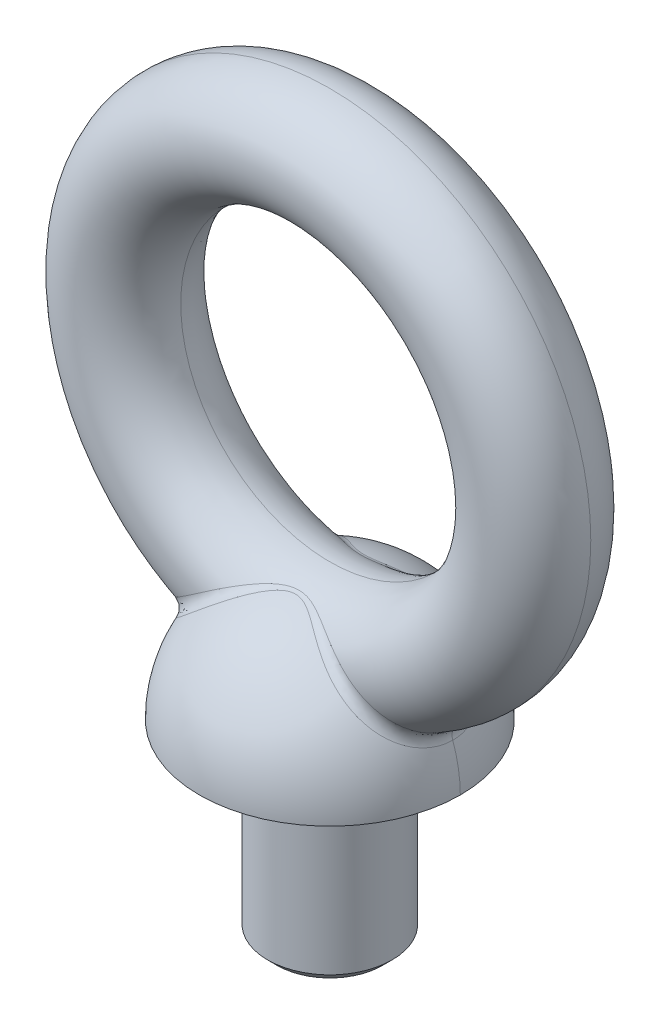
ISO-10303-21;
HEADER;
FILE_DESCRIPTION(('STEP AP214'),'2;1');
FILE_NAME('part.step','',(''),(''),'','','');
FILE_SCHEMA(('AUTOMOTIVE_DESIGN { 1 0 10303 214 1 1 1 1 }'));
ENDSEC;
DATA;
#1=APPLICATION_CONTEXT('core data for automotive mechanical design processes');
#2=APPLICATION_PROTOCOL_DEFINITION('international standard','automotive_design',2000,#1);
#3=PRODUCT_CONTEXT('',#1,'mechanical');
#4=PRODUCT('Part','Part','',(#3));
#5=PRODUCT_RELATED_PRODUCT_CATEGORY('part','',(#4));
#6=PRODUCT_DEFINITION_FORMATION('','',#4);
#7=PRODUCT_DEFINITION_CONTEXT('part definition',#1,'design');
#8=PRODUCT_DEFINITION('design','',#6,#7);
#9=PRODUCT_DEFINITION_SHAPE('','',#8);
#10=(LENGTH_UNIT() NAMED_UNIT(*) SI_UNIT(.MILLI.,.METRE.));
#11=(NAMED_UNIT(*) PLANE_ANGLE_UNIT() SI_UNIT($,.RADIAN.));
#12=(NAMED_UNIT(*) SI_UNIT($,.STERADIAN.) SOLID_ANGLE_UNIT());
#13=UNCERTAINTY_MEASURE_WITH_UNIT(LENGTH_MEASURE(1.E-05),#10,'distance_accuracy_value','');
#14=(GEOMETRIC_REPRESENTATION_CONTEXT(3) GLOBAL_UNCERTAINTY_ASSIGNED_CONTEXT((#13)) GLOBAL_UNIT_ASSIGNED_CONTEXT((#10,
#11,#12)) REPRESENTATION_CONTEXT('',''));
#15=CARTESIAN_POINT('',(0.,0.,0.));
#16=DIRECTION('',(0.,0.,1.));
#17=DIRECTION('',(1.,0.,0.));
#18=AXIS2_PLACEMENT_3D('',#15,#16,#17);
#19=CARTESIAN_POINT('',(-4.41999999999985,-38.,-4.429210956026));
#20=DIRECTION('',(0.,-1.,0.));
#21=DIRECTION('',(1.,0.,0.));
#22=AXIS2_PLACEMENT_3D('',#19,#20,#21);
#23=PLANE('',#22);
#24=CARTESIAN_POINT('',(0.,-37.9999999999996,0.));
#25=DIRECTION('',(0.,1.,0.));
#26=DIRECTION('',(0.,0.,1.));
#27=AXIS2_PLACEMENT_3D('',#24,#25,#26);
#28=CIRCLE('',#27,4.24999999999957);
#29=CARTESIAN_POINT('',(0.,-37.9999999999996,4.24999999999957));
#30=VERTEX_POINT('',#29);
#31=EDGE_CURVE('E190',#30,#30,#28,.F.);
#32=ORIENTED_EDGE('',*,*,#31,.T.);
#33=EDGE_LOOP('',(#32));
#34=FACE_BOUND('',#33,.T.);
#35=ADVANCED_FACE('F24',(#34),#23,.T.);
#36=CARTESIAN_POINT('',(0.,-37.2500000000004,0.));
#37=DIRECTION('',(0.,1.,0.));
#38=DIRECTION('',(0.,0.,1.));
#39=AXIS2_PLACEMENT_3D('',#36,#37,#38);
#40=CONICAL_SURFACE('',#39,5.00000000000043,0.785398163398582);
#41=CARTESIAN_POINT('',(0.,-37.25,0.));
#42=DIRECTION('',(0.,-1.,0.));
#43=DIRECTION('',(1.,0.,0.));
#44=AXIS2_PLACEMENT_3D('',#41,#42,#43);
#45=CIRCLE('',#44,5.);
#46=CARTESIAN_POINT('',(5.,-37.25,0.));
#47=VERTEX_POINT('',#46);
#48=EDGE_CURVE('E185',#47,#47,#45,.T.);
#49=ORIENTED_EDGE('',*,*,#48,.T.);
#50=EDGE_LOOP('',(#49));
#51=FACE_BOUND('',#50,.T.);
#52=ORIENTED_EDGE('',*,*,#31,.F.);
#53=EDGE_LOOP('',(#52));
#54=FACE_BOUND('',#53,.T.);
#55=ADVANCED_FACE('F278',(#51,#54),#40,.T.);
#56=CARTESIAN_POINT('',(0.,-23.,0.));
#57=DIRECTION('',(0.,-1.,0.));
#58=DIRECTION('',(0.,0.,-1.));
#59=AXIS2_PLACEMENT_3D('',#56,#57,#58);
#60=CYLINDRICAL_SURFACE('',#59,5.);
#61=ORIENTED_EDGE('',*,*,#48,.F.);
#62=EDGE_LOOP('',(#61));
#63=FACE_BOUND('',#62,.T.);
#64=CARTESIAN_POINT('',(0.,-23.,0.));
#65=DIRECTION('',(0.,-1.,0.));
#66=DIRECTION('',(0.,0.,-1.));
#67=AXIS2_PLACEMENT_3D('',#64,#65,#66);
#68=CIRCLE('',#67,5.);
#69=CARTESIAN_POINT('',(0.,-23.,-5.));
#70=VERTEX_POINT('',#69);
#71=EDGE_CURVE('E64',#70,#70,#68,.T.);
#72=ORIENTED_EDGE('',*,*,#71,.T.);
#73=EDGE_LOOP('',(#72));
#74=FACE_BOUND('',#73,.T.);
#75=ADVANCED_FACE('F176',(#63,#74),#60,.T.);
#76=CARTESIAN_POINT('',(-10.9199999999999,-23.,10.93094107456));
#77=DIRECTION('',(0.,1.,0.));
#78=DIRECTION('',(1.,0.,0.));
#79=AXIS2_PLACEMENT_3D('',#76,#77,#78);
#80=PLANE('',#79);
#81=ORIENTED_EDGE('',*,*,#71,.F.);
#82=EDGE_LOOP('',(#81));
#83=FACE_BOUND('',#82,.T.);
#84=CARTESIAN_POINT('',(0.,-23.,0.));
#85=DIRECTION('',(0.,1.,0.));
#86=DIRECTION('',(0.,0.,1.));
#87=AXIS2_PLACEMENT_3D('',#84,#85,#86);
#88=CIRCLE('',#87,10.5);
#89=CARTESIAN_POINT('',(-10.4999999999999,-23.,0.));
#90=VERTEX_POINT('',#89);
#91=CARTESIAN_POINT('',(10.5000000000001,-23.,0.));
#92=VERTEX_POINT('',#91);
#93=EDGE_CURVE('E62',#90,#92,#88,.F.);
#94=ORIENTED_EDGE('',*,*,#93,.T.);
#95=CARTESIAN_POINT('',(0.,-23.,0.));
#96=DIRECTION('',(0.,1.,0.));
#97=DIRECTION('',(0.,0.,1.));
#98=AXIS2_PLACEMENT_3D('',#95,#96,#97);
#99=CIRCLE('',#98,10.5000000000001);
#100=EDGE_CURVE('E57',#92,#90,#99,.F.);
#101=ORIENTED_EDGE('',*,*,#100,.T.);
#102=EDGE_LOOP('',(#94,#101));
#103=FACE_BOUND('',#102,.T.);
#104=ADVANCED_FACE('F26',(#83,#103),#80,.F.);
#105=CARTESIAN_POINT('',(10.4964238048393,-23.2740206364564,0.));
#106=CARTESIAN_POINT('',(10.6309654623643,-18.1203713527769,0.));
#107=CARTESIAN_POINT('',(7.5007166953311,-14.0240626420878,0.));
#108=CARTESIAN_POINT('',(2.4926935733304,-12.8001726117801,0.));
#109=(BOUNDED_CURVE() B_SPLINE_CURVE(3,(#105,#106,#107,#108),.UNSPECIFIED.,.F.,
.F.) B_SPLINE_CURVE_WITH_KNOTS((4,4),(0.,1.),
.UNSPECIFIED.) CURVE() GEOMETRIC_REPRESENTATION_ITEM() RATIONAL_B_SPLINE_CURVE((1.,
0.852299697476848,0.852299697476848,1.)) REPRESENTATION_ITEM(''));
#110=CARTESIAN_POINT('',(0.,-23.,0.));
#111=DIRECTION('',(0.,1.,0.));
#112=AXIS1_PLACEMENT('',#110,#111);
#113=SURFACE_OF_REVOLUTION('',#109,#112);
#114=ORIENTED_EDGE('',*,*,#100,.F.);
#115=CARTESIAN_POINT('',(0.,-23.,0.));
#116=DIRECTION('',(0.,0.,1.));
#117=DIRECTION('',(1.,0.,0.));
#118=AXIS2_PLACEMENT_3D('',#115,#116,#117);
#119=CIRCLE('',#118,10.5);
#120=CARTESIAN_POINT('',(9.89303957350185,-19.4818066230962,1.20434272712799E-10));
#121=VERTEX_POINT('',#120);
#122=EDGE_CURVE('E70',#92,#121,#119,.T.);
#123=ORIENTED_EDGE('',*,*,#122,.T.);
#124=CARTESIAN_POINT('',(9.89304331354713,-19.4818052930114,0.));
#125=CARTESIAN_POINT('',(9.89304364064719,-19.48180564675,0.0554813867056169));
#126=CARTESIAN_POINT('',(9.89234414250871,-19.4811516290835,0.110962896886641));
#127=CARTESIAN_POINT('',(9.88954756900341,-19.4785340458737,0.221805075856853));
#128=CARTESIAN_POINT('',(9.88745186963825,-19.4765717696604,0.277165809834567));
#129=CARTESIAN_POINT('',(9.88186634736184,-19.4713381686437,0.387727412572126));
#130=CARTESIAN_POINT('',(9.87837721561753,-19.4680674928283,0.442928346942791));
#131=CARTESIAN_POINT('',(9.87000825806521,-19.460218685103,0.553131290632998));
#132=CARTESIAN_POINT('',(9.86512843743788,-19.4556405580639,0.608133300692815));
#133=CARTESIAN_POINT('',(9.85398078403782,-19.445178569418,0.717899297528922));
#134=CARTESIAN_POINT('',(9.84771227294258,-19.4392940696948,0.772663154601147));
#135=CARTESIAN_POINT('',(9.83378937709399,-19.4262214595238,0.881913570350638));
#136=CARTESIAN_POINT('',(9.82613363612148,-19.4190320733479,0.936399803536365));
#137=CARTESIAN_POINT('',(9.80943784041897,-19.4033521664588,1.04505541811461));
#138=CARTESIAN_POINT('',(9.80039576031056,-19.3948597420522,1.09922421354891));
#139=CARTESIAN_POINT('',(9.78092830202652,-19.3765766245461,1.20720501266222));
#140=CARTESIAN_POINT('',(9.77050024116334,-19.3667834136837,1.26101610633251));
#141=CARTESIAN_POINT('',(9.74826132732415,-19.3459020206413,1.36824106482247));
#142=CARTESIAN_POINT('',(9.73644714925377,-19.3348107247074,1.42165363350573));
#143=CARTESIAN_POINT('',(9.71143600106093,-19.3113368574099,1.52804052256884));
#144=CARTESIAN_POINT('',(9.69823508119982,-19.2989505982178,1.58101310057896));
#145=CARTESIAN_POINT('',(9.67045011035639,-19.2728911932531,1.68647823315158));
#146=CARTESIAN_POINT('',(9.65586150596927,-19.2592138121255,1.73896854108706));
#147=CARTESIAN_POINT('',(9.62530007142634,-19.2305763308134,1.84342677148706));
#148=CARTESIAN_POINT('',(9.60932210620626,-19.2156114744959,1.89539188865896));
#149=CARTESIAN_POINT('',(9.5759819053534,-19.1844066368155,1.99875568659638));
#150=CARTESIAN_POINT('',(9.55861398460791,-19.1681614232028,2.0501509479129));
#151=CARTESIAN_POINT('',(9.51404723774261,-19.1265031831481,2.17620890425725));
#152=CARTESIAN_POINT('',(9.48608543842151,-19.1003895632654,2.25037334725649));
#153=CARTESIAN_POINT('',(9.42727222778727,-19.0455088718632,2.39699048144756));
#154=CARTESIAN_POINT('',(9.39640795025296,-19.0167299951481,2.46943357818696));
#155=CARTESIAN_POINT('',(9.33180400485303,-18.9565463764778,2.61247403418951));
#156=CARTESIAN_POINT('',(9.2980490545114,-18.9251276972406,2.68305862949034));
#157=CARTESIAN_POINT('',(9.22767740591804,-18.8596937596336,2.82223890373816));
#158=CARTESIAN_POINT('',(9.19104321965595,-18.8256626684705,2.89081829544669));
#159=CARTESIAN_POINT('',(9.11492762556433,-18.7550393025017,3.02584060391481));
#160=CARTESIAN_POINT('',(9.07542676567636,-18.7184295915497,3.09226342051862));
#161=CARTESIAN_POINT('',(8.9935890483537,-18.6426854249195,3.22282440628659));
#162=CARTESIAN_POINT('',(8.95123099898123,-18.6035322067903,3.28693845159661));
#163=CARTESIAN_POINT('',(8.88574025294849,-18.5430927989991,3.38104761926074));
#164=CARTESIAN_POINT('',(8.86350430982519,-18.5225877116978,3.41217741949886));
#165=CARTESIAN_POINT('',(8.81186807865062,-18.4750095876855,3.48261164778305));
#166=CARTESIAN_POINT('',(8.78226847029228,-18.4477640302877,3.52165441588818));
#167=CARTESIAN_POINT('',(8.72195632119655,-18.3923071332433,3.59858562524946));
#168=CARTESIAN_POINT('',(8.69123889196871,-18.364091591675,3.63646719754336));
#169=CARTESIAN_POINT('',(8.62869907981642,-18.3067098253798,3.71103595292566));
#170=CARTESIAN_POINT('',(8.59687160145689,-18.2775392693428,3.74771553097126));
#171=CARTESIAN_POINT('',(8.53212069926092,-18.2182637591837,3.81983775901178));
#172=CARTESIAN_POINT('',(8.49919200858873,-18.1881543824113,3.85527204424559));
#173=CARTESIAN_POINT('',(8.4322480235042,-18.1270188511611,3.92486092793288));
#174=CARTESIAN_POINT('',(8.3982273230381,-18.0959882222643,3.95900639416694));
#175=CARTESIAN_POINT('',(8.32910928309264,-18.0330291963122,4.0259740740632));
#176=CARTESIAN_POINT('',(8.29400643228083,-18.0010963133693,4.05878638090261));
#177=CARTESIAN_POINT('',(8.22273470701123,-17.9363532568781,4.12304355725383));
#178=CARTESIAN_POINT('',(8.18656024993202,-17.90353862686,4.15447774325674));
#179=CARTESIAN_POINT('',(8.11315667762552,-17.8370541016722,4.2159338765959));
#180=CARTESIAN_POINT('',(8.07592194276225,-17.8033798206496,4.24594436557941));
#181=CARTESIAN_POINT('',(8.00041002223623,-17.7351996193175,4.30450770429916));
#182=CARTESIAN_POINT('',(7.96212721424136,-17.7006894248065,4.33304832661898));
#183=CARTESIAN_POINT('',(7.88453226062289,-17.6308627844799,4.3886261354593));
#184=CARTESIAN_POINT('',(7.84521452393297,-17.5955422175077,4.41565033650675));
#185=CARTESIAN_POINT('',(7.76556392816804,-17.524121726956,4.46814860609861));
#186=CARTESIAN_POINT('',(7.72522554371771,-17.4880178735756,4.49360894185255));
#187=CARTESIAN_POINT('',(7.64354866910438,-17.4150605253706,4.54293411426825));
#188=CARTESIAN_POINT('',(7.60220475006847,-17.378203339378,4.56678450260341));
#189=CARTESIAN_POINT('',(7.51853420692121,-17.3037672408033,4.61283769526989));
#190=CARTESIAN_POINT('',(7.47620229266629,-17.2661848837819,4.63502530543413));
#191=CARTESIAN_POINT('',(7.38193505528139,-17.182694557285,4.68203070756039));
#192=CARTESIAN_POINT('',(7.32985774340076,-17.1367027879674,4.70641592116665));
#193=CARTESIAN_POINT('',(7.22458999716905,-17.0440259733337,4.75259452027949));
#194=CARTESIAN_POINT('',(7.17139491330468,-16.9973384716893,4.77437235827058));
#195=CARTESIAN_POINT('',(7.06393707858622,-16.9033228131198,4.81527445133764));
#196=CARTESIAN_POINT('',(7.0096698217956,-16.8559924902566,4.83438189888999));
#197=CARTESIAN_POINT('',(6.90011667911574,-16.7607527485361,4.86988732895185));
#198=CARTESIAN_POINT('',(6.84482651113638,-16.7128415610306,4.88626731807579));
#199=CARTESIAN_POINT('',(6.71922376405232,-16.6043730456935,4.92005066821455));
#200=CARTESIAN_POINT('',(6.64873410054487,-16.5437585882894,4.93661766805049));
#201=CARTESIAN_POINT('',(6.50634880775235,-16.4218411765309,4.96531168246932));
#202=CARTESIAN_POINT('',(6.43444627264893,-16.3605368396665,4.97739856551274));
#203=CARTESIAN_POINT('',(6.31887219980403,-16.2625320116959,4.99315966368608));
#204=CARTESIAN_POINT('',(6.27541533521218,-16.2258009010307,4.99826493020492));
#205=CARTESIAN_POINT('',(6.18789398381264,-16.1521375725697,5.00700172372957));
#206=CARTESIAN_POINT('',(6.14382745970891,-16.115206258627,5.01062050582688));
#207=CARTESIAN_POINT('',(6.04018785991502,-16.0287061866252,5.01729085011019));
#208=CARTESIAN_POINT('',(5.98052939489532,-15.9791899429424,5.0197120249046));
#209=CARTESIAN_POINT('',(5.86024303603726,-15.8799310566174,5.02178438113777));
#210=CARTESIAN_POINT('',(5.79961171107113,-15.8301919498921,5.02140468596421));
#211=CARTESIAN_POINT('',(5.6774414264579,-15.7305744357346,5.01780766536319));
#212=CARTESIAN_POINT('',(5.61589978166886,-15.6807004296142,5.01455942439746));
#213=CARTESIAN_POINT('',(5.49198187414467,-15.5809027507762,5.00515239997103));
#214=CARTESIAN_POINT('',(5.42960375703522,-15.5309843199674,4.99896266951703));
#215=CARTESIAN_POINT('',(5.30406738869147,-15.4312043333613,4.98364892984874));
#216=CARTESIAN_POINT('',(5.24090787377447,-15.3813489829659,4.97449452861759));
#217=CARTESIAN_POINT('',(5.1415073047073,-15.3033658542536,4.957709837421));
#218=CARTESIAN_POINT('',(5.10525764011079,-15.2750271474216,4.95109081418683));
#219=CARTESIAN_POINT('',(4.97912427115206,-15.1768443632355,4.92644270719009));
#220=CARTESIAN_POINT('',(4.88922369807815,-15.1076140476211,4.90601898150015));
#221=CARTESIAN_POINT('',(4.68661665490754,-14.9537989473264,4.85438923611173));
#222=CARTESIAN_POINT('',(4.57387161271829,-14.8697407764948,4.82176307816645));
#223=CARTESIAN_POINT('',(4.36231516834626,-14.7149047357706,4.75325713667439));
#224=CARTESIAN_POINT('',(4.26348407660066,-14.6437589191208,4.71826165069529));
#225=CARTESIAN_POINT('',(4.03044475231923,-14.4791222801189,4.62923396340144));
#226=CARTESIAN_POINT('',(3.89629287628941,-14.3867945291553,4.5728811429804));
#227=CARTESIAN_POINT('',(3.67740246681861,-14.2405227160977,4.47327765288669));
#228=CARTESIAN_POINT('',(3.59252822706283,-14.1848855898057,4.43276834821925));
#229=CARTESIAN_POINT('',(3.44203649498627,-14.0882889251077,4.35786097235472));
#230=CARTESIAN_POINT('',(3.37638927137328,-14.0468469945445,4.32414267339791));
#231=CARTESIAN_POINT('',(3.22620291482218,-13.9539343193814,4.24524975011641));
#232=CARTESIAN_POINT('',(3.14161981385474,-13.9029773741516,4.19955220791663));
#233=CARTESIAN_POINT('',(2.98065223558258,-13.8085896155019,4.11014794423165));
#234=CARTESIAN_POINT('',(2.90427711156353,-13.7649107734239,4.06668540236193));
#235=CARTESIAN_POINT('',(2.7435811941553,-13.6755316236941,3.9735021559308));
#236=CARTESIAN_POINT('',(2.65923606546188,-13.6300718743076,3.92359242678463));
#237=CARTESIAN_POINT('',(2.51979404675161,-13.5576632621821,3.84028522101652));
#238=CARTESIAN_POINT('',(2.4649015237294,-13.5298531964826,3.80728975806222));
#239=CARTESIAN_POINT('',(2.34155957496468,-13.4689694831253,3.73283445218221));
#240=CARTESIAN_POINT('',(2.27302023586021,-13.4362356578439,3.69124481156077));
#241=CARTESIAN_POINT('',(2.14104179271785,-13.375455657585,3.61114650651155));
#242=CARTESIAN_POINT('',(2.07765704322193,-13.3472465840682,3.57267198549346));
#243=CARTESIAN_POINT('',(1.98411219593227,-13.3072014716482,3.51629419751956));
#244=CARTESIAN_POINT('',(1.95426777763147,-13.2946594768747,3.49836706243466));
#245=CARTESIAN_POINT('',(1.89230336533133,-13.2691327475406,3.46135450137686));
#246=CARTESIAN_POINT('',(1.86016825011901,-13.2561770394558,3.44227436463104));
#247=CARTESIAN_POINT('',(1.76680546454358,-13.2193733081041,3.38723344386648));
#248=CARTESIAN_POINT('',(1.70524396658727,-13.1961384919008,3.35142565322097));
#249=CARTESIAN_POINT('',(1.58549746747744,-13.1530790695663,3.28316549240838));
#250=CARTESIAN_POINT('',(1.52738952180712,-13.1331293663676,3.25065749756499));
#251=CARTESIAN_POINT('',(1.42752001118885,-13.1006128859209,3.19635690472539));
#252=CARTESIAN_POINT('',(1.3860598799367,-13.0876206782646,3.17426385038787));
#253=CARTESIAN_POINT('',(1.27615193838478,-13.0546128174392,3.117212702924));
#254=CARTESIAN_POINT('',(1.20713937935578,-13.0353223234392,3.08290767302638));
#255=CARTESIAN_POINT('',(1.08475699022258,-13.0038547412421,3.02554227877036));
#256=CARTESIAN_POINT('',(1.03183910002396,-12.9911116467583,3.00183034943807));
#257=CARTESIAN_POINT('',(0.927628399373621,-12.9678599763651,2.95784071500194));
#258=CARTESIAN_POINT('',(0.876404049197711,-12.9572675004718,2.93744630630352));
#259=CARTESIAN_POINT('',(0.775971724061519,-12.938247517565,2.90030584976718));
#260=CARTESIAN_POINT('',(0.726837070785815,-12.9297262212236,2.88341163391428));
#261=CARTESIAN_POINT('',(0.653149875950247,-12.918197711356,2.86029828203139));
#262=CARTESIAN_POINT('',(0.629001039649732,-12.9146147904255,2.85307046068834));
#263=CARTESIAN_POINT('',(0.580895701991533,-12.9078804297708,2.83942029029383));
#264=CARTESIAN_POINT('',(0.556943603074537,-12.9047223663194,2.83298575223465));
#265=CARTESIAN_POINT('',(0.503286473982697,-12.89809554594,2.8194279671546));
#266=CARTESIAN_POINT('',(0.473523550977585,-12.8947220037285,2.81248593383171));
#267=CARTESIAN_POINT('',(0.414065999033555,-12.8886015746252,2.79983795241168));
#268=CARTESIAN_POINT('',(0.384375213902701,-12.8858473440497,2.79411756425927));
#269=CARTESIAN_POINT('',(0.337360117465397,-12.881964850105,2.78601141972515));
#270=CARTESIAN_POINT('',(0.320117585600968,-12.8806416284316,2.78323868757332));
#271=CARTESIAN_POINT('',(0.28575998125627,-12.8782090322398,2.77812677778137));
#272=CARTESIAN_POINT('',(0.268645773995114,-12.8770973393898,2.77578291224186));
#273=CARTESIAN_POINT('',(0.228875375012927,-12.8747529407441,2.77083192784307));
#274=CARTESIAN_POINT('',(0.206195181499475,-12.8735950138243,2.76837987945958));
#275=CARTESIAN_POINT('',(0.160921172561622,-12.8716488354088,2.76425772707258));
#276=CARTESIAN_POINT('',(0.138328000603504,-12.870857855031,2.76258185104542));
#277=CARTESIAN_POINT('',(0.0931464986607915,-12.8696401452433,2.76000796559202));
#278=CARTESIAN_POINT('',(0.0705583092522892,-12.8692124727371,2.75910794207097));
#279=CARTESIAN_POINT('',(0.025304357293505,-12.8687176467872,2.75807743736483));
#280=CARTESIAN_POINT('',(0.00263854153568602,-12.8686513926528,2.75794887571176));
#281=CARTESIAN_POINT('',(-0.0428542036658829,-12.8688768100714,2.75844663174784));
#282=CARTESIAN_POINT('',(-0.0656810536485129,-12.8691711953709,2.75907867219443));
#283=CARTESIAN_POINT('',(-0.111548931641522,-12.8701184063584,2.76108470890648));
#284=CARTESIAN_POINT('',(-0.134589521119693,-12.8707751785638,2.76246687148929));
#285=CARTESIAN_POINT('',(-0.18056925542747,-12.8724542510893,2.76599774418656));
#286=CARTESIAN_POINT('',(-0.203508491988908,-12.8734760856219,2.76814547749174));
#287=CARTESIAN_POINT('',(-0.249366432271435,-12.8758878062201,2.7732118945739));
#288=CARTESIAN_POINT('',(-0.27228476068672,-12.8772790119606,2.77613334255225));
#289=CARTESIAN_POINT('',(-0.318180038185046,-12.8804342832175,2.78274966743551));
#290=CARTESIAN_POINT('',(-0.341155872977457,-12.8822013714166,2.78645081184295));
#291=CARTESIAN_POINT('',(-0.387243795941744,-12.8861148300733,2.79462477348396));
#292=CARTESIAN_POINT('',(-0.410353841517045,-12.8882657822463,2.79910689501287));
#293=CARTESIAN_POINT('',(-0.450890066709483,-12.8923601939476,2.80760381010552));
#294=CARTESIAN_POINT('',(-0.468354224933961,-12.8942303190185,2.81147414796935));
#295=CARTESIAN_POINT('',(-0.503432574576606,-12.8981930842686,2.81964284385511));
#296=CARTESIAN_POINT('',(-0.521045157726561,-12.900288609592,2.82394669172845));
#297=CARTESIAN_POINT('',(-0.569264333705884,-12.9063110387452,2.83626471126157));
#298=CARTESIAN_POINT('',(-0.599752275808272,-12.9104369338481,2.84464948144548));
#299=CARTESIAN_POINT('',(-0.660998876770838,-12.9193541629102,2.86264232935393));
#300=CARTESIAN_POINT('',(-0.691749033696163,-12.9241580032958,2.87227302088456));
#301=CARTESIAN_POINT('',(-0.747298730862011,-12.9334048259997,2.89066036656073));
#302=CARTESIAN_POINT('',(-0.772166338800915,-12.9377553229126,2.89925891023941));
#303=CARTESIAN_POINT('',(-0.822203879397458,-12.9469212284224,2.91724747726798));
#304=CARTESIAN_POINT('',(-0.847367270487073,-12.9517451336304,2.92665131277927));
#305=CARTESIAN_POINT('',(-0.924402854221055,-12.9671452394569,2.95643738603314));
#306=CARTESIAN_POINT('',(-0.975810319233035,-12.9783141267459,2.97772128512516));
#307=CARTESIAN_POINT('',(-1.08024160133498,-13.0027073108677,3.02337507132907));
#308=CARTESIAN_POINT('',(-1.13320045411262,-13.0160105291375,3.04784999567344));
#309=CARTESIAN_POINT('',(-1.24150573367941,-13.044982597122,3.10005953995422));
#310=CARTESIAN_POINT('',(-1.29677288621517,-13.0607504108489,3.12790268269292));
#311=CARTESIAN_POINT('',(-1.42519984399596,-13.0994987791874,3.19472676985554));
#312=CARTESIAN_POINT('',(-1.4979109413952,-13.1230830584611,3.23421884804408));
#313=CARTESIAN_POINT('',(-1.61298807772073,-13.16283693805,3.29866187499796));
#314=CARTESIAN_POINT('',(-1.65590051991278,-13.1782162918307,3.32313639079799));
#315=CARTESIAN_POINT('',(-1.7597193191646,-13.2166730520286,3.38310549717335));
#316=CARTESIAN_POINT('',(-1.82035898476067,-13.2401966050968,3.41877647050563));
#317=CARTESIAN_POINT('',(-1.94582731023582,-13.2908854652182,3.49332257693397));
#318=CARTESIAN_POINT('',(-2.01058683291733,-13.3181910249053,3.53221834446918));
#319=CARTESIAN_POINT('',(-2.10905084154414,-13.3613451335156,3.59166334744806));
#320=CARTESIAN_POINT('',(-2.14303063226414,-13.3765394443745,3.61223410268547));
#321=CARTESIAN_POINT('',(-2.20776719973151,-13.4060532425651,3.651499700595));
#322=CARTESIAN_POINT('',(-2.23854122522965,-13.420329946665,3.67019827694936));
#323=CARTESIAN_POINT('',(-2.33544218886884,-13.4660182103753,3.72905794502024));
#324=CARTESIAN_POINT('',(-2.40132618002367,-13.4981651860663,3.76905034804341));
#325=CARTESIAN_POINT('',(-2.53915792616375,-13.5674820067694,3.85210231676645));
#326=CARTESIAN_POINT('',(-2.61106494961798,-13.6048349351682,3.89507682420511));
#327=CARTESIAN_POINT('',(-2.74091396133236,-13.6743035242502,3.97168669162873));
#328=CARTESIAN_POINT('',(-2.79891377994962,-13.7060660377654,4.0055452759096));
#329=CARTESIAN_POINT('',(-2.94405902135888,-13.7873473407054,4.08926367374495));
#330=CARTESIAN_POINT('',(-3.03107666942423,-13.8377060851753,4.13853539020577));
#331=CARTESIAN_POINT('',(-3.19892010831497,-13.937547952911,4.23080371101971));
#332=CARTESIAN_POINT('',(-3.27974970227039,-13.9868422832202,4.27399779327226));
#333=CARTESIAN_POINT('',(-3.45169303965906,-14.0941303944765,4.36291791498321));
#334=CARTESIAN_POINT('',(-3.54280862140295,-14.152433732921,4.40826838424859));
#335=CARTESIAN_POINT('',(-3.71515776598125,-14.2653056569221,4.49039434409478));
#336=CARTESIAN_POINT('',(-3.79638820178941,-14.3195906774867,4.52756599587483));
#337=CARTESIAN_POINT('',(-3.941660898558,-14.4183901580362,4.59086518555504));
#338=CARTESIAN_POINT('',(-4.00567498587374,-14.4625198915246,4.61765760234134));
#339=CARTESIAN_POINT('',(-4.12941220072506,-14.5488944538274,4.66718733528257));
#340=CARTESIAN_POINT('',(-4.18912901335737,-14.591061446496,4.69007669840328));
#341=CARTESIAN_POINT('',(-4.34688817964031,-14.7037606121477,4.74792372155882));
#342=CARTESIAN_POINT('',(-4.44494775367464,-14.7751405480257,4.78120650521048));
#343=CARTESIAN_POINT('',(-4.63953623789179,-14.9189348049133,4.84111010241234));
#344=CARTESIAN_POINT('',(-4.73606182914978,-14.9913090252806,4.86783752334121));
#345=CARTESIAN_POINT('',(-4.89262262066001,-15.1103716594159,4.90631464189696));
#346=CARTESIAN_POINT('',(-4.95267930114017,-15.1564441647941,4.91990987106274));
#347=CARTESIAN_POINT('',(-5.0692572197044,-15.2466132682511,4.94397328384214));
#348=CARTESIAN_POINT('',(-5.12578151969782,-15.2906695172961,4.95457708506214));
#349=CARTESIAN_POINT('',(-5.23522149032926,-15.3765773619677,4.97297643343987));
#350=CARTESIAN_POINT('',(-5.2881417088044,-15.4183944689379,4.98090615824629));
#351=CARTESIAN_POINT('',(-5.39032164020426,-15.4996225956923,4.99427466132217));
#352=CARTESIAN_POINT('',(-5.43958673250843,-15.5390049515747,4.99984568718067));
#353=CARTESIAN_POINT('',(-5.53444315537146,-15.6151589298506,5.00874260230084));
#354=CARTESIAN_POINT('',(-5.58003852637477,-15.6519098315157,5.01220334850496));
#355=CARTESIAN_POINT('',(-5.69263743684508,-15.7430414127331,5.01875340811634));
#356=CARTESIAN_POINT('',(-5.7595887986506,-15.7975566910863,5.02089658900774));
#357=CARTESIAN_POINT('',(-5.89153235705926,-15.9057472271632,5.02180529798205));
#358=CARTESIAN_POINT('',(-5.95653314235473,-15.959411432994,5.02065030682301));
#359=CARTESIAN_POINT('',(-6.0845314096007,-16.0657252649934,5.01508407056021));
#360=CARTESIAN_POINT('',(-6.1475387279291,-16.1183672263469,5.01075392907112));
#361=CARTESIAN_POINT('',(-6.27148943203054,-16.2224983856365,4.99903086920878));
#362=CARTESIAN_POINT('',(-6.33244450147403,-16.2739827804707,4.99171879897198));
#363=CARTESIAN_POINT('',(-6.45225117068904,-16.3756645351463,4.97420535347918));
#364=CARTESIAN_POINT('',(-6.51111597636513,-16.425860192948,4.96408488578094));
#365=CARTESIAN_POINT('',(-6.61260564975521,-16.5127633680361,4.94393268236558));
#366=CARTESIAN_POINT('',(-6.6553592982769,-16.5494842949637,4.93460253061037));
#367=CARTESIAN_POINT('',(-6.73965791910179,-16.6220821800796,4.91449937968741));
#368=CARTESIAN_POINT('',(-6.78120955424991,-16.6579608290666,4.90376036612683));
#369=CARTESIAN_POINT('',(-6.89438895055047,-16.7559156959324,4.87218919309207));
#370=CARTESIAN_POINT('',(-6.96567953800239,-16.8178680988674,4.84973930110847));
#371=CARTESIAN_POINT('',(-7.10640849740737,-16.9406384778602,4.80024400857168));
#372=CARTESIAN_POINT('',(-7.17585786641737,-17.00146164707,4.77324270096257));
#373=CARTESIAN_POINT('',(-7.29921622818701,-17.1098920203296,4.72058219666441));
#374=CARTESIAN_POINT('',(-7.35337660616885,-17.1576381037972,4.69579443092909));
#375=CARTESIAN_POINT('',(-7.46040500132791,-17.2522573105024,4.6434427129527));
#376=CARTESIAN_POINT('',(-7.51327914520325,-17.2991340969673,4.61589793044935));
#377=CARTESIAN_POINT('',(-7.61768890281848,-17.3919532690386,4.55810344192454));
#378=CARTESIAN_POINT('',(-7.66923072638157,-17.4378996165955,4.52787131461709));
#379=CARTESIAN_POINT('',(-7.77093258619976,-17.528808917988,4.46478327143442));
#380=CARTESIAN_POINT('',(-7.82109881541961,-17.5737759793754,4.43194326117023));
#381=CARTESIAN_POINT('',(-7.92027111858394,-17.6628905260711,4.36350582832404));
#382=CARTESIAN_POINT('',(-7.96927714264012,-17.7070379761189,4.32790828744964));
#383=CARTESIAN_POINT('',(-8.06556987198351,-17.7939627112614,4.25432307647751));
#384=CARTESIAN_POINT('',(-8.11286867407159,-17.8367491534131,4.21636206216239));
#385=CARTESIAN_POINT('',(-8.20572349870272,-17.9209081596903,4.13815565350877));
#386=CARTESIAN_POINT('',(-8.25129165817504,-17.9622901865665,4.09793485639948));
#387=CARTESIAN_POINT('',(-8.34066430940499,-18.043593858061,4.01530394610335));
#388=CARTESIAN_POINT('',(-8.38448086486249,-18.0835252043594,3.97291643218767));
#389=CARTESIAN_POINT('',(-8.47033156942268,-18.1618871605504,3.88604776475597));
#390=CARTESIAN_POINT('',(-8.51237759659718,-18.2003275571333,3.84158718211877));
#391=CARTESIAN_POINT('',(-8.59467039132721,-18.2756707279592,3.7506655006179));
#392=CARTESIAN_POINT('',(-8.63492873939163,-18.3125832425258,3.70422295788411));
#393=CARTESIAN_POINT('',(-8.71363091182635,-18.3848376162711,3.60942863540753));
#394=CARTESIAN_POINT('',(-8.752085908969,-18.420189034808,3.56109342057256));
#395=CARTESIAN_POINT('',(-8.82716744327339,-18.4892916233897,3.46260289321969));
#396=CARTESIAN_POINT('',(-8.86380463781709,-18.5230520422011,3.41246219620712));
#397=CARTESIAN_POINT('',(-8.93523766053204,-18.5889462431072,3.31044781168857));
#398=CARTESIAN_POINT('',(-8.97004352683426,-18.6210888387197,3.25858684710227));
#399=CARTESIAN_POINT('',(-9.03780190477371,-18.6837240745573,3.15321668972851));
#400=CARTESIAN_POINT('',(-9.07076373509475,-18.7142249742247,3.09971840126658));
#401=CARTESIAN_POINT('',(-9.13482223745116,-18.7735558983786,2.99115715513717));
#402=CARTESIAN_POINT('',(-9.16592741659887,-18.8023935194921,2.93610336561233));
#403=CARTESIAN_POINT('',(-9.22626263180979,-18.8583807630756,2.82450942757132));
#404=CARTESIAN_POINT('',(-9.25550026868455,-18.8855372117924,2.76797682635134));
#405=CARTESIAN_POINT('',(-9.29797811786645,-18.9250276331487,2.68205016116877));
#406=CARTESIAN_POINT('',(-9.31188889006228,-18.9379662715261,2.65326157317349));
#407=CARTESIAN_POINT('',(-9.3392383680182,-18.963416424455,2.5953429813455));
#408=CARTESIAN_POINT('',(-9.35267783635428,-18.9759286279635,2.56621364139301));
#409=CARTESIAN_POINT('',(-9.37936153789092,-19.000784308,2.50700683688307));
#410=CARTESIAN_POINT('',(-9.39259684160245,-19.0131197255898,2.47692196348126));
#411=CARTESIAN_POINT('',(-9.41854657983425,-19.0373179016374,2.41647575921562));
#412=CARTESIAN_POINT('',(-9.43126260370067,-19.0491820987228,2.38611568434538));
#413=CARTESIAN_POINT('',(-9.46857251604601,-19.0840092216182,2.29477676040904));
#414=CARTESIAN_POINT('',(-9.49245545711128,-19.1063252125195,2.23325688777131));
#415=CARTESIAN_POINT('',(-9.53813594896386,-19.1490412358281,2.10923571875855));
#416=CARTESIAN_POINT('',(-9.55994459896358,-19.1694514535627,2.04674200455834));
#417=CARTESIAN_POINT('',(-9.60148093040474,-19.2083473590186,1.9208543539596));
#418=CARTESIAN_POINT('',(-9.62121851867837,-19.2268422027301,1.85746651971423));
#419=CARTESIAN_POINT('',(-9.65861525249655,-19.2618991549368,1.72987280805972));
#420=CARTESIAN_POINT('',(-9.6762830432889,-19.2784692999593,1.66567167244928));
#421=CARTESIAN_POINT('',(-9.70954242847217,-19.3096704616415,1.53653048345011));
#422=CARTESIAN_POINT('',(-9.72514133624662,-19.3243083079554,1.47159396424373));
#423=CARTESIAN_POINT('',(-9.754264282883,-19.3516397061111,1.34105945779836));
#424=CARTESIAN_POINT('',(-9.76779424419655,-19.364338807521,1.27546395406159));
#425=CARTESIAN_POINT('',(-9.79277969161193,-19.3877887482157,1.14368721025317));
#426=CARTESIAN_POINT('',(-9.80423965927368,-19.3985437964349,1.0775075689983));
#427=CARTESIAN_POINT('',(-9.8250844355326,-19.4181027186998,0.944636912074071));
#428=CARTESIAN_POINT('',(-9.83447224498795,-19.4269094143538,0.87794678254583));
#429=CARTESIAN_POINT('',(-9.85117082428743,-19.4425696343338,0.744128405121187));
#430=CARTESIAN_POINT('',(-9.85848308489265,-19.4494245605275,0.677000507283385));
#431=CARTESIAN_POINT('',(-9.87102752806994,-19.4611802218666,0.542379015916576));
#432=CARTESIAN_POINT('',(-9.8762596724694,-19.4660809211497,0.474885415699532));
#433=CARTESIAN_POINT('',(-9.8846391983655,-19.4739274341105,0.339604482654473));
#434=CARTESIAN_POINT('',(-9.88778500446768,-19.4768717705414,0.271816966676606));
#435=CARTESIAN_POINT('',(-9.89198711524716,-19.4808072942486,0.136019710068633));
#436=CARTESIAN_POINT('',(-9.89304031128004,-19.4817955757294,0.068009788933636));
#437=CARTESIAN_POINT('',(-9.89304331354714,-19.4818052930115,-7.90492697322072E-12));
#438=B_SPLINE_CURVE_WITH_KNOTS('',3,(#124,#125,#126,#127,#128,#129,#130,#131,#132,#133,#134,
#135,#136,#137,#138,#139,#140,#141,#142,#143,#144,#145,#146,#147,#148,#149,#150,#151,#152,#153,
#154,#155,#156,#157,#158,#159,#160,#161,#162,#163,#164,#165,#166,#167,#168,#169,#170,#171,#172,
#173,#174,#175,#176,#177,#178,#179,#180,#181,#182,#183,#184,#185,#186,#187,#188,#189,#190,#191,
#192,#193,#194,#195,#196,#197,#198,#199,#200,#201,#202,#203,#204,#205,#206,#207,#208,#209,#210,
#211,#212,#213,#214,#215,#216,#217,#218,#219,#220,#221,#222,#223,#224,#225,#226,#227,#228,#229,
#230,#231,#232,#233,#234,#235,#236,#237,#238,#239,#240,#241,#242,#243,#244,#245,#246,#247,#248,
#249,#250,#251,#252,#253,#254,#255,#256,#257,#258,#259,#260,#261,#262,#263,#264,#265,#266,#267,
#268,#269,#270,#271,#272,#273,#274,#275,#276,#277,#278,#279,#280,#281,#282,#283,#284,#285,#286,
#287,#288,#289,#290,#291,#292,#293,#294,#295,#296,#297,#298,#299,#300,#301,#302,#303,#304,#305,
#306,#307,#308,#309,#310,#311,#312,#313,#314,#315,#316,#317,#318,#319,#320,#321,#322,#323,#324,
#325,#326,#327,#328,#329,#330,#331,#332,#333,#334,#335,#336,#337,#338,#339,#340,#341,#342,#343,
#344,#345,#346,#347,#348,#349,#350,#351,#352,#353,#354,#355,#356,#357,#358,#359,#360,#361,#362,
#363,#364,#365,#366,#367,#368,#369,#370,#371,#372,#373,#374,#375,#376,#377,#378,#379,#380,#381,
#382,#383,#384,#385,#386,#387,#388,#389,#390,#391,#392,#393,#394,#395,#396,#397,#398,#399,#400,
#401,#402,#403,#404,#405,#406,#407,#408,#409,#410,#411,#412,#413,#414,#415,#416,#417,#418,#419,
#420,#421,#422,#423,#424,#425,#426,#427,#428,#429,#430,#431,#432,#433,#434,#435,#436,#437),
.UNSPECIFIED.,.F.,.F.,(4,2,2,2,2,2,2,2,2,2,2,2,2,2,2,2,2,2,2,2,2,2,2,2,2,2,2,2,2,2,2,2,2,2,2,2,
2,2,2,2,2,2,2,2,2,2,2,2,2,2,2,2,2,2,2,2,2,2,2,2,2,2,2,2,2,2,2,2,2,2,2,2,2,2,2,2,2,2,2,2,2,2,2,2,
2,2,2,2,2,2,2,2,2,2,2,2,2,2,2,2,2,2,2,2,2,2,2,2,2,2,2,2,2,2,2,2,2,2,2,2,2,2,2,2,2,2,2,2,2,2,2,2,
2,2,2,2,2,2,2,2,2,2,2,2,2,2,2,2,2,2,2,2,2,2,2,2,4),(0.,0.166436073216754,0.332708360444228,
0.498898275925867,0.665087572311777,0.831358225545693,0.997792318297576,1.16447192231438,
1.33147898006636,1.49889518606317,1.66680186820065,1.83527986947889,2.00440943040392,
2.17427007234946,2.42450920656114,2.67591520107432,2.92874380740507,3.18324849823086,
3.43967955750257,3.69828316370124,3.82848596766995,3.99663498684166,4.16563792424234,
4.33555881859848,4.50646082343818,4.67840609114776,4.85145565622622,5.02566931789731,
5.20110552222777,5.37782124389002,5.55587186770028,5.73531107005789,5.91619070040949,
6.09856066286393,6.31940343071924,6.54150360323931,6.76494414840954,6.98980488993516,
7.27298371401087,7.55864114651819,7.73000960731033,7.90281814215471,8.13546922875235,
8.37068884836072,8.60847489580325,8.84881999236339,9.09171138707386,9.23116070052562,
9.5768916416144,10.0097386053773,10.3897108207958,10.9062988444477,11.2340369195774,
11.4879254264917,11.814282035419,12.1086369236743,12.4326852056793,12.6421433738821,
12.9019031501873,13.13987714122,13.2508897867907,13.3695504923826,13.5942577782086,
13.8027441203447,13.948960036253,14.187187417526,14.3652407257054,14.5335966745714,
14.6914592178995,14.7678303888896,14.8428223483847,14.9350369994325,15.0260925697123,
15.0786298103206,15.1305530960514,15.1990624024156,15.2670537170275,15.3348679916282,
15.4028509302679,15.4713485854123,15.5406073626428,15.6097780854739,15.6791993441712,
15.749201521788,15.8201031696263,15.8740540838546,15.9288039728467,16.0244404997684,
16.1221541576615,16.2021517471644,16.2840212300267,16.4541901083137,16.6336486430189,
16.8251882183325,17.0832181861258,17.2384286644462,17.4609459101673,17.701897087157,
17.8294786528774,17.9456853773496,18.1961831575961,18.4713110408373,18.6941711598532,
19.0299898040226,19.3421208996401,19.6939093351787,20.007433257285,20.2541062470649,
20.4838889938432,20.8610402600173,21.231576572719,21.4622543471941,21.6795552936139,
21.8832627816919,22.073185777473,22.2491580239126,22.5081803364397,22.7610136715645,
23.0076043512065,23.2479121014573,23.4819099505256,23.6532634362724,23.8210585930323,
24.1121609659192,24.4005901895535,24.6295417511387,24.8569994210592,25.0830655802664,
25.3078456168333,25.5326353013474,25.7552356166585,25.9757605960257,26.1943283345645,
26.4110606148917,26.6260825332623,26.8395221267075,27.0515100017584,27.2621789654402,
27.4716636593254,27.6801001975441,27.88762580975,27.9910957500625,28.0943897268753,
28.1996996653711,28.3046585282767,28.5135823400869,28.7213166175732,28.9280069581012,
29.1338006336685,29.3388462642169,29.5432934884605,29.7472926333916,29.9509943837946,
30.1545494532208,30.358108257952,30.561820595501,30.7658353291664),.UNSPECIFIED.);
#439=CARTESIAN_POINT('',(-9.89303942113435,-19.4818066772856,-1.61007937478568E-10));
#440=VERTEX_POINT('',#439);
#441=EDGE_CURVE('E73',#121,#440,#438,.T.);
#442=ORIENTED_EDGE('',*,*,#441,.T.);
#443=CARTESIAN_POINT('',(0.,-23.,0.));
#444=DIRECTION('',(0.,0.,1.));
#445=DIRECTION('',(1.,0.,0.));
#446=AXIS2_PLACEMENT_3D('',#443,#444,#445);
#447=CIRCLE('',#446,10.5);
#448=EDGE_CURVE('E63',#440,#90,#447,.T.);
#449=ORIENTED_EDGE('',*,*,#448,.T.);
#450=EDGE_LOOP('',(#114,#123,#442,#449));
#451=FACE_BOUND('',#450,.T.);
#452=ADVANCED_FACE('F72',(#451),#113,.T.);
#453=CARTESIAN_POINT('',(10.496423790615,-23.274021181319,0.));
#454=CARTESIAN_POINT('',(10.6309660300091,-18.120359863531,0.));
#455=CARTESIAN_POINT('',(7.50070463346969,-14.0240456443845,0.));
#456=CARTESIAN_POINT('',(2.49266657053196,-12.8001660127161,0.));
#457=(BOUNDED_CURVE() B_SPLINE_CURVE(3,(#453,#454,#455,#456),.UNSPECIFIED.,.F.,
.F.) B_SPLINE_CURVE_WITH_KNOTS((4,4),(0.,1.),
.UNSPECIFIED.) CURVE() GEOMETRIC_REPRESENTATION_ITEM() RATIONAL_B_SPLINE_CURVE((1.,
0.852299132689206,0.852299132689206,1.)) REPRESENTATION_ITEM(''));
#458=CARTESIAN_POINT('',(0.,-23.,0.));
#459=DIRECTION('',(0.,1.,0.));
#460=AXIS1_PLACEMENT('',#458,#459);
#461=SURFACE_OF_REVOLUTION('',#457,#460);
#462=ORIENTED_EDGE('',*,*,#93,.F.);
#463=ORIENTED_EDGE('',*,*,#448,.F.);
#464=CARTESIAN_POINT('',(-9.89304331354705,-19.4818052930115,-7.90492697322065E-12));
#465=CARTESIAN_POINT('',(-9.89304355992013,-19.4818054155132,-0.0555857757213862));
#466=CARTESIAN_POINT('',(-9.89234136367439,-19.4811487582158,-0.111171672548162));
#467=CARTESIAN_POINT('',(-9.88953417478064,-19.478521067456,-0.222221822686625));
#468=CARTESIAN_POINT('',(-9.88743057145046,-19.4765513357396,-0.277686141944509));
#469=CARTESIAN_POINT('',(-9.88182405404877,-19.4712979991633,-0.388453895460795));
#470=CARTESIAN_POINT('',(-9.87832183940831,-19.4680150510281,-0.443757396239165));
#471=CARTESIAN_POINT('',(-9.8699215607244,-19.4601368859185,-0.554164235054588));
#472=CARTESIAN_POINT('',(-9.86502350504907,-19.4555416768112,-0.609267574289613));
#473=CARTESIAN_POINT('',(-9.85383425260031,-19.4450407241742,-0.71923477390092));
#474=CARTESIAN_POINT('',(-9.84754237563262,-19.4391343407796,-0.774098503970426));
#475=CARTESIAN_POINT('',(-9.83356764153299,-19.4260131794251,-0.883546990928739));
#476=CARTESIAN_POINT('',(-9.82588342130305,-19.4187971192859,-0.938131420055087));
#477=CARTESIAN_POINT('',(-9.80912557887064,-19.4030590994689,-1.04698153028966));
#478=CARTESIAN_POINT('',(-9.80004991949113,-19.3945352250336,-1.10124662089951));
#479=CARTESIAN_POINT('',(-9.78051022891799,-19.3761844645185,-1.20941788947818));
#480=CARTESIAN_POINT('',(-9.77004349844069,-19.3663550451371,-1.26332315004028));
#481=CARTESIAN_POINT('',(-9.74772218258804,-19.345396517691,-1.37073409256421));
#482=CARTESIAN_POINT('',(-9.73586425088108,-19.3342642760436,-1.42423846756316));
#483=CARTESIAN_POINT('',(-9.71076054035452,-19.3107038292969,-1.53080638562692));
#484=CARTESIAN_POINT('',(-9.69751078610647,-19.2982719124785,-1.58386817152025));
#485=CARTESIAN_POINT('',(-9.66962309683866,-19.2721165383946,-1.68950889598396));
#486=CARTESIAN_POINT('',(-9.65498057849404,-19.2583888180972,-1.74208556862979));
#487=CARTESIAN_POINT('',(-9.62430626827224,-19.2296460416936,-1.84671345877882));
#488=CARTESIAN_POINT('',(-9.60826930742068,-19.2146261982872,-1.89876184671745));
#489=CARTESIAN_POINT('',(-9.57480607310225,-19.183306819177,-2.00228885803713));
#490=CARTESIAN_POINT('',(-9.55737407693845,-19.1670020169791,-2.05376403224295));
#491=CARTESIAN_POINT('',(-9.51264753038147,-19.1251953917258,-2.18000195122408));
#492=CARTESIAN_POINT('',(-9.48458783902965,-19.0989910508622,-2.2542639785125));
#493=CARTESIAN_POINT('',(-9.42556964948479,-19.0439207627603,-2.40106728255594));
#494=CARTESIAN_POINT('',(-9.39459820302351,-19.0150429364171,-2.47359888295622));
#495=CARTESIAN_POINT('',(-9.32977084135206,-18.9546534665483,-2.6168066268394));
#496=CARTESIAN_POINT('',(-9.29589954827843,-18.9231278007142,-2.68746989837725));
#497=CARTESIAN_POINT('',(-9.2252862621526,-18.8574721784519,-2.82679703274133));
#498=CARTESIAN_POINT('',(-9.18852667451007,-18.8233262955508,-2.89544447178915));
#499=CARTESIAN_POINT('',(-9.11215146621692,-18.7524659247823,-3.03059158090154));
#500=CARTESIAN_POINT('',(-9.07251627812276,-18.715733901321,-3.09707098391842));
#501=CARTESIAN_POINT('',(-8.99040122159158,-18.639737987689,-3.22773301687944));
#502=CARTESIAN_POINT('',(-8.94790003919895,-18.6004552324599,-3.29189132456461));
#503=CARTESIAN_POINT('',(-8.8821892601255,-18.5398174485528,-3.38605631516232));
#504=CARTESIAN_POINT('',(-8.85987856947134,-18.5192450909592,-3.41720332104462));
#505=CARTESIAN_POINT('',(-8.80807214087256,-18.4715141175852,-3.48766874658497));
#506=CARTESIAN_POINT('',(-8.77837669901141,-18.4441827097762,-3.52672430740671));
#507=CARTESIAN_POINT('',(-8.71786949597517,-18.3885514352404,-3.60367581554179));
#508=CARTESIAN_POINT('',(-8.68705280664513,-18.3602473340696,-3.64156481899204));
#509=CARTESIAN_POINT('',(-8.62431113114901,-18.3026859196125,-3.71614292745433));
#510=CARTESIAN_POINT('',(-8.59238101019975,-18.2734242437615,-3.752824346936));
#511=CARTESIAN_POINT('',(-8.52742153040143,-18.2139641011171,-3.82494449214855));
#512=CARTESIAN_POINT('',(-8.49438686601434,-18.1837611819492,-3.86037476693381));
#513=CARTESIAN_POINT('',(-8.42722769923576,-18.1224363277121,-3.92994961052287));
#514=CARTESIAN_POINT('',(-8.3930977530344,-18.0913098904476,-3.96408495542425));
#515=CARTESIAN_POINT('',(-8.32375805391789,-18.0281571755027,-4.03102611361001));
#516=CARTESIAN_POINT('',(-8.28854275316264,-17.996126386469,-4.06382192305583));
#517=CARTESIAN_POINT('',(-8.21704303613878,-17.9311856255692,-4.12803956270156));
#518=CARTESIAN_POINT('',(-8.18075300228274,-17.8982711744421,-4.15945060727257));
#519=CARTESIAN_POINT('',(-8.10711527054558,-17.8315853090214,-4.22085365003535));
#520=CARTESIAN_POINT('',(-8.06976191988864,-17.7978094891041,-4.25083408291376));
#521=CARTESIAN_POINT('',(-7.9940098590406,-17.7294247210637,-4.30933023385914));
#522=CARTESIAN_POINT('',(-7.95560549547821,-17.6948114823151,-4.33783361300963));
#523=CARTESIAN_POINT('',(-7.8777646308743,-17.6247774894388,-4.39332959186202));
#524=CARTESIAN_POINT('',(-7.83832251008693,-17.5893526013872,-4.42030909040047));
#525=CARTESIAN_POINT('',(-7.75842046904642,-17.5177224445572,-4.47271034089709));
#526=CARTESIAN_POINT('',(-7.71795499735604,-17.4815132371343,-4.49811824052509));
#527=CARTESIAN_POINT('',(-7.63602140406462,-17.4083444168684,-4.54733066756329));
#528=CARTESIAN_POINT('',(-7.59454783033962,-17.371381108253,-4.5711206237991));
#529=CARTESIAN_POINT('',(-7.51061559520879,-17.2967322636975,-4.61704478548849));
#530=CARTESIAN_POINT('',(-7.46815162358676,-17.2590432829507,-4.63916367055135));
#531=CARTESIAN_POINT('',(-7.37362578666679,-17.1753486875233,-4.68599145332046));
#532=CARTESIAN_POINT('',(-7.32142253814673,-17.1292600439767,-4.71026758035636));
#533=CARTESIAN_POINT('',(-7.21590428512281,-17.0363930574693,-4.75621870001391));
#534=CARTESIAN_POINT('',(-7.16258464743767,-16.9896122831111,-4.77787812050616));
#535=CARTESIAN_POINT('',(-7.05487941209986,-16.8954139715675,-4.81853407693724));
#536=CARTESIAN_POINT('',(-7.00048932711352,-16.8479942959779,-4.8375137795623));
#537=CARTESIAN_POINT('',(-6.89069258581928,-16.7525800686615,-4.87275445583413));
#538=CARTESIAN_POINT('',(-6.83528166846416,-16.7045837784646,-4.88899740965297));
#539=CARTESIAN_POINT('',(-6.7094098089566,-16.5959289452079,-4.92246193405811));
#540=CARTESIAN_POINT('',(-6.63877255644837,-16.5352146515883,-4.93884485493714));
#541=CARTESIAN_POINT('',(-6.4960966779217,-16.4131051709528,-4.9671561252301));
#542=CARTESIAN_POINT('',(-6.42405119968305,-16.3517086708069,-4.97904428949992));
#543=CARTESIAN_POINT('',(-6.30832965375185,-16.2536294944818,-4.99446936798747));
#544=CARTESIAN_POINT('',(-6.2648671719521,-16.2169131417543,-4.99944331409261));
#545=CARTESIAN_POINT('',(-6.17733923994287,-16.1432852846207,-5.00791961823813));
#546=CARTESIAN_POINT('',(-6.13327178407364,-16.1063747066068,-5.01140935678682));
#547=CARTESIAN_POINT('',(-6.02963678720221,-16.0199306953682,-5.01778056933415));
#548=CARTESIAN_POINT('',(-5.96998472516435,-15.97045106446,-5.02003321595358));
#549=CARTESIAN_POINT('',(-5.8497199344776,-15.8712753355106,-5.02177295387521));
#550=CARTESIAN_POINT('',(-5.78910384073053,-15.8215828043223,-5.02122947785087));
#551=CARTESIAN_POINT('',(-5.66697281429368,-15.7220681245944,-5.01731025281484));
#552=CARTESIAN_POINT('',(-5.60545525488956,-15.6722503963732,-5.01390390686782));
#553=CARTESIAN_POINT('',(-5.4815948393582,-15.5725742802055,-5.00418583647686));
#554=CARTESIAN_POINT('',(-5.41925018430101,-15.5227211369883,-4.99784348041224));
#555=CARTESIAN_POINT('',(-5.2937884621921,-15.4230814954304,-4.98223393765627));
#556=CARTESIAN_POINT('',(-5.23067016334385,-15.3733012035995,-4.97293671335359));
#557=CARTESIAN_POINT('',(-5.1319789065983,-15.2959362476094,-4.95603439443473));
#558=CARTESIAN_POINT('',(-5.09639439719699,-15.2681370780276,-4.94945882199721));
#559=CARTESIAN_POINT('',(-4.97164611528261,-15.1710920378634,-4.92483543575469));
#560=CARTESIAN_POINT('',(-4.88247001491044,-15.1024541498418,-4.9044195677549));
#561=CARTESIAN_POINT('',(-4.68050818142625,-14.9492030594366,-4.85266574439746));
#562=CARTESIAN_POINT('',(-4.56768144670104,-14.8651360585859,-4.81986742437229));
#563=CARTESIAN_POINT('',(-4.35546978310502,-14.7099322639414,-4.75088380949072));
#564=CARTESIAN_POINT('',(-4.25606615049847,-14.6384383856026,-4.71555184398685));
#565=CARTESIAN_POINT('',(-4.02288996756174,-14.4738781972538,-4.62612829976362));
#566=CARTESIAN_POINT('',(-3.88917357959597,-14.3819453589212,-4.56978360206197));
#567=CARTESIAN_POINT('',(-3.67082285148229,-14.2361846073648,-4.47018055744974));
#568=CARTESIAN_POINT('',(-3.58605454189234,-14.1806761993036,-4.42963291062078));
#569=CARTESIAN_POINT('',(-3.43556614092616,-14.0841894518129,-4.35458282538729));
#570=CARTESIAN_POINT('',(-3.36981713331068,-14.0427331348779,-4.32075087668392));
#571=CARTESIAN_POINT('',(-3.21968070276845,-13.9499712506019,-4.2417482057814));
#572=CARTESIAN_POINT('',(-3.13524952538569,-13.899172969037,-4.19606354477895));
#573=CARTESIAN_POINT('',(-2.97453767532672,-13.8050646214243,-4.10668844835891));
#574=CARTESIAN_POINT('',(-2.89826676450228,-13.7615078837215,-4.06323937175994));
#575=CARTESIAN_POINT('',(-2.73774249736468,-13.6723571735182,-3.97007448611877));
#576=CARTESIAN_POINT('',(-2.65346427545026,-13.6270047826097,-3.92017008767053));
#577=CARTESIAN_POINT('',(-2.5141602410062,-13.5547876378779,-3.83690275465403));
#578=CARTESIAN_POINT('',(-2.45934035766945,-13.5270615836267,-3.80393788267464));
#579=CARTESIAN_POINT('',(-2.33615205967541,-13.4663603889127,-3.72955563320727));
#580=CARTESIAN_POINT('',(-2.26769306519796,-13.4337246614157,-3.68801041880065));
#581=CARTESIAN_POINT('',(-2.13585669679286,-13.3731258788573,-3.60800326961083));
#582=CARTESIAN_POINT('',(-2.07253391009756,-13.3450003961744,-3.56957450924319));
#583=CARTESIAN_POINT('',(-1.97907390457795,-13.3050748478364,-3.51326899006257));
#584=CARTESIAN_POINT('',(-1.94925370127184,-13.2925696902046,-3.4953644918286));
#585=CARTESIAN_POINT('',(-1.88735393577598,-13.2671251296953,-3.4584102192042));
#586=CARTESIAN_POINT('',(-1.85525931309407,-13.2542145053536,-3.43936584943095));
#587=CARTESIAN_POINT('',(-1.76200896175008,-13.2175386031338,-3.38442996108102));
#588=CARTESIAN_POINT('',(-1.70051841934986,-13.1943855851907,-3.34869477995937));
#589=CARTESIAN_POINT('',(-1.58090002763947,-13.1514792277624,-3.28058060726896));
#590=CARTESIAN_POINT('',(-1.52284932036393,-13.1316011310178,-3.24814538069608));
#591=CARTESIAN_POINT('',(-1.42307029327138,-13.0992035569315,-3.19397408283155));
#592=CARTESIAN_POINT('',(-1.38164388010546,-13.0862591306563,-3.17193516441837));
#593=CARTESIAN_POINT('',(-1.27185141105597,-13.0533843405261,-3.11504631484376));
#594=CARTESIAN_POINT('',(-1.20292064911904,-13.0341776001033,-3.08085203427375));
#595=CARTESIAN_POINT('',(-1.08067545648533,-13.0028526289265,-3.02368944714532));
#596=CARTESIAN_POINT('',(-1.02781233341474,-12.9901690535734,-3.0000665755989));
#597=CARTESIAN_POINT('',(-0.923697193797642,-12.9670275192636,-2.95624535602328));
#598=CARTESIAN_POINT('',(-0.872513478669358,-12.9564861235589,-2.93593072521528));
#599=CARTESIAN_POINT('',(-0.796119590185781,-12.9420865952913,-2.90779660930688));
#600=CARTESIAN_POINT('',(-0.771374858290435,-12.9376242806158,-2.89901449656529));
#601=CARTESIAN_POINT('',(-0.722180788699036,-12.9291640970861,-2.88225540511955));
#602=CARTESIAN_POINT('',(-0.69773760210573,-12.9251579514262,-2.87426462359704));
#603=CARTESIAN_POINT('',(-0.649089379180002,-12.9175928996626,-2.85909077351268));
#604=CARTESIAN_POINT('',(-0.624889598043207,-12.9140265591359,-2.85189459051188));
#605=CARTESIAN_POINT('',(-0.576668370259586,-12.9073240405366,-2.83830461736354));
#606=CARTESIAN_POINT('',(-0.552651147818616,-12.9041814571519,-2.83189904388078));
#607=CARTESIAN_POINT('',(-0.509806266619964,-12.8989326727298,-2.82115472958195));
#608=CARTESIAN_POINT('',(-0.491023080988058,-12.896752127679,-2.81667469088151));
#609=CARTESIAN_POINT('',(-0.453495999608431,-12.8926402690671,-2.80820077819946));
#610=CARTESIAN_POINT('',(-0.434753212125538,-12.8907069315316,-2.80420297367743));
#611=CARTESIAN_POINT('',(-0.388077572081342,-12.8861915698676,-2.79483281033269));
#612=CARTESIAN_POINT('',(-0.36007680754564,-12.8837470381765,-2.78972874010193));
#613=CARTESIAN_POINT('',(-0.304334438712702,-12.8794265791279,-2.78067662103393));
#614=CARTESIAN_POINT('',(-0.276596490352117,-12.8775417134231,-2.77671043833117));
#615=CARTESIAN_POINT('',(-0.226088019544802,-12.8746070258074,-2.77052801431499));
#616=CARTESIAN_POINT('',(-0.203345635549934,-12.8734672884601,-2.76812389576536));
#617=CARTESIAN_POINT('',(-0.157864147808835,-12.871554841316,-2.76409075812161));
#618=CARTESIAN_POINT('',(-0.135125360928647,-12.8707807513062,-2.76245882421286));
#619=CARTESIAN_POINT('',(-0.0863046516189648,-12.8695098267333,-2.75978290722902));
#620=CARTESIAN_POINT('',(-0.0602146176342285,-12.8690692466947,-2.75885801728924));
#621=CARTESIAN_POINT('',(-0.0145886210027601,-12.8687074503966,-2.75809353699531));
#622=CARTESIAN_POINT('',(0.00494343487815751,-12.8686833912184,-2.75803930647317));
#623=CARTESIAN_POINT('',(0.0471458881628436,-12.8689180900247,-2.75852691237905));
#624=CARTESIAN_POINT('',(0.0698150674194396,-12.8692230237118,-2.75916616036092));
#625=CARTESIAN_POINT('',(0.115102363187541,-12.8701939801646,-2.7612126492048));
#626=CARTESIAN_POINT('',(0.13772049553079,-12.8708598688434,-2.7626196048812));
#627=CARTESIAN_POINT('',(0.182987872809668,-12.8725538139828,-2.76620096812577));
#628=CARTESIAN_POINT('',(0.205636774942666,-12.8735835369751,-2.76837890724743));
#629=CARTESIAN_POINT('',(0.251047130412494,-12.8760083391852,-2.77349899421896));
#630=CARTESIAN_POINT('',(0.273807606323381,-12.8774067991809,-2.77644821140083));
#631=CARTESIAN_POINT('',(0.312905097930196,-12.8801151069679,-2.78213878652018));
#632=CARTESIAN_POINT('',(0.329273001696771,-12.8813419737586,-2.78471096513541));
#633=CARTESIAN_POINT('',(0.376127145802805,-12.8851148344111,-2.79259561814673));
#634=CARTESIAN_POINT('',(0.406523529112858,-12.887880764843,-2.79834720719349));
#635=CARTESIAN_POINT('',(0.460546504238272,-12.8933587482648,-2.8096789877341));
#636=CARTESIAN_POINT('',(0.484232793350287,-12.8959562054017,-2.81503355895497));
#637=CARTESIAN_POINT('',(0.531727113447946,-12.9015495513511,-2.82651338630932));
#638=CARTESIAN_POINT('',(0.555532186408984,-12.9045505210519,-2.83264840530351));
#639=CARTESIAN_POINT('',(0.606812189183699,-12.9114306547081,-2.8466434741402));
#640=CARTESIAN_POINT('',(0.634246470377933,-12.9153730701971,-2.8546212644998));
#641=CARTESIAN_POINT('',(0.689454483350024,-12.9238133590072,-2.8715827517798));
#642=CARTESIAN_POINT('',(0.717220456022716,-12.9283223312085,-2.8805860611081));
#643=CARTESIAN_POINT('',(0.78844724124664,-12.9405449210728,-2.90480529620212));
#644=CARTESIAN_POINT('',(0.831656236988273,-12.9485986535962,-2.92059214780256));
#645=CARTESIAN_POINT('',(0.926803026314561,-12.9676676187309,-2.95746616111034));
#646=CARTESIAN_POINT('',(0.978534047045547,-12.9789424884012,-2.97894947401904));
#647=CARTESIAN_POINT('',(1.08383059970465,-13.0036058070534,-3.025073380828));
#648=CARTESIAN_POINT('',(1.13732710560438,-13.0170791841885,-3.04982504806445));
#649=CARTESIAN_POINT('',(1.23820875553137,-13.0441425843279,-3.0985067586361));
#650=CARTESIAN_POINT('',(1.28569691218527,-13.0576034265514,-3.12229653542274));
#651=CARTESIAN_POINT('',(1.39681646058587,-13.0907162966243,-3.17971143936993));
#652=CARTESIAN_POINT('',(1.46007471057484,-13.110846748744,-3.21378190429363));
#653=CARTESIAN_POINT('',(1.58219845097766,-13.1519294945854,-3.28133827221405));
#654=CARTESIAN_POINT('',(1.64112577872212,-13.1727908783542,-3.31476873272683));
#655=CARTESIAN_POINT('',(1.7626035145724,-13.2177725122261,-3.38483222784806));
#656=CARTESIAN_POINT('',(1.82507964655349,-13.2420200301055,-3.42151226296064));
#657=CARTESIAN_POINT('',(1.9246300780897,-13.2823298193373,-3.48063513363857));
#658=CARTESIAN_POINT('',(1.96198868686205,-13.2978413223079,-3.5029776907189));
#659=CARTESIAN_POINT('',(2.02460325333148,-13.3244719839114,-3.54064053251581));
#660=CARTESIAN_POINT('',(2.04994159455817,-13.3354247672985,-3.55594167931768));
#661=CARTESIAN_POINT('',(2.13845096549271,-13.3742695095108,-3.60951142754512));
#662=CARTESIAN_POINT('',(2.20130396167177,-13.4029032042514,-3.64777011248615));
#663=CARTESIAN_POINT('',(2.33253337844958,-13.4646648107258,-3.72748738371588));
#664=CARTESIAN_POINT('',(2.40085909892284,-13.4979600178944,-3.76889949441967));
#665=CARTESIAN_POINT('',(2.5432098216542,-13.5695435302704,-3.85453944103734));
#666=CARTESIAN_POINT('',(2.61719420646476,-13.6080115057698,-3.89868517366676));
#667=CARTESIAN_POINT('',(2.71319442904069,-13.6594855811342,-3.95527163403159));
#668=CARTESIAN_POINT('',(2.73539540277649,-13.6714984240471,-3.96830915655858));
#669=CARTESIAN_POINT('',(2.80387141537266,-13.7088918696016,-4.00838260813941));
#670=CARTESIAN_POINT('',(2.85007717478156,-13.7346061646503,-4.03522662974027));
#671=CARTESIAN_POINT('',(2.96895517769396,-13.8018864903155,-4.10350313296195));
#672=CARTESIAN_POINT('',(3.04156454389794,-13.8440632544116,-4.14444603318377));
#673=CARTESIAN_POINT('',(3.19638439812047,-13.9360653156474,-4.22958713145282));
#674=CARTESIAN_POINT('',(3.27859155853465,-13.9861633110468,-4.27349727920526));
#675=CARTESIAN_POINT('',(3.45286306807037,-14.0948776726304,-4.36355007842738));
#676=CARTESIAN_POINT('',(3.54492780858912,-14.1537952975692,-4.409329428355));
#677=CARTESIAN_POINT('',(3.71817716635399,-14.267307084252,-4.49178630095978));
#678=CARTESIAN_POINT('',(3.79935974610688,-14.3215875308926,-4.52889977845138));
#679=CARTESIAN_POINT('',(3.944640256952,-14.4204354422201,-4.59212998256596));
#680=CARTESIAN_POINT('',(4.00870946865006,-14.4646209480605,-4.61890944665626));
#681=CARTESIAN_POINT('',(4.13177251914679,-14.55056074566,-4.66809997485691));
#682=CARTESIAN_POINT('',(4.19075910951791,-14.5922238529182,-4.69068916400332));
#683=CARTESIAN_POINT('',(4.34851998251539,-14.7049372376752,-4.74851015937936));
#684=CARTESIAN_POINT('',(4.44731354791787,-14.776866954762,-4.7820007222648));
#685=CARTESIAN_POINT('',(4.64256448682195,-14.9211973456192,-4.84198079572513));
#686=CARTESIAN_POINT('',(4.73901705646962,-14.9935390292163,-4.86862732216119));
#687=CARTESIAN_POINT('',(4.89548008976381,-15.112559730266,-4.90698182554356));
#688=CARTESIAN_POINT('',(4.9555120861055,-15.1586250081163,-4.92053319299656));
#689=CARTESIAN_POINT('',(5.07206002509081,-15.2487925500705,-4.94451572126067));
#690=CARTESIAN_POINT('',(5.12857903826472,-15.2928547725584,-4.95508177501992));
#691=CARTESIAN_POINT('',(5.23802818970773,-15.378788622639,-4.97341048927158));
#692=CARTESIAN_POINT('',(5.29096287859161,-15.4206260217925,-4.98130664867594));
#693=CARTESIAN_POINT('',(5.39319166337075,-15.5019097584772,-4.99461111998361));
#694=CARTESIAN_POINT('',(5.44249114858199,-15.5413276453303,-5.00015104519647));
#695=CARTESIAN_POINT('',(5.53743615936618,-15.6175686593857,-5.00898771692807));
#696=CARTESIAN_POINT('',(5.58308577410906,-15.6543712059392,-5.01241866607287));
#697=CARTESIAN_POINT('',(5.69568553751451,-15.7455233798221,-5.0188822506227));
#698=CARTESIAN_POINT('',(5.76258334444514,-15.8000065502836,-5.02097320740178));
#699=CARTESIAN_POINT('',(5.89442631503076,-15.9081355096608,-5.02178172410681));
#700=CARTESIAN_POINT('',(5.95938004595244,-15.9617703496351,-5.02057841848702));
#701=CARTESIAN_POINT('',(6.08729067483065,-16.0680288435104,-5.01491949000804));
#702=CARTESIAN_POINT('',(6.15025738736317,-16.1206449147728,-5.01054460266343));
#703=CARTESIAN_POINT('',(6.27413350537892,-16.2247281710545,-4.99873504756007));
#704=CARTESIAN_POINT('',(6.33505456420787,-16.2761906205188,-4.99138085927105));
#705=CARTESIAN_POINT('',(6.45479984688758,-16.377832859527,-4.97378543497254));
#706=CARTESIAN_POINT('',(6.51363724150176,-16.4280109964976,-4.96362473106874));
#707=CARTESIAN_POINT('',(6.61508310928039,-16.5148863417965,-4.9434034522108));
#708=CARTESIAN_POINT('',(6.65782051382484,-16.5515972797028,-4.93404389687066));
#709=CARTESIAN_POINT('',(6.74209030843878,-16.6241781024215,-4.91388249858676));
#710=CARTESIAN_POINT('',(6.78362934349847,-16.6600496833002,-4.90311447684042));
#711=CARTESIAN_POINT('',(6.89674235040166,-16.7579572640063,-4.87147326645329));
#712=CARTESIAN_POINT('',(6.96797905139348,-16.8198689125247,-4.84898486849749));
#713=CARTESIAN_POINT('',(7.1086024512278,-16.9425582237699,-4.79941729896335));
#714=CARTESIAN_POINT('',(7.1780001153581,-17.0033410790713,-4.77238203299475));
#715=CARTESIAN_POINT('',(7.30126702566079,-17.1116992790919,-4.71966462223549));
#716=CARTESIAN_POINT('',(7.35538767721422,-17.1594137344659,-4.6948528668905));
#717=CARTESIAN_POINT('',(7.46233814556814,-17.2539703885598,-4.64245585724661));
#718=CARTESIAN_POINT('',(7.51517406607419,-17.3008162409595,-4.61488967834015));
#719=CARTESIAN_POINT('',(7.61950893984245,-17.3935743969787,-4.5570549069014));
#720=CARTESIAN_POINT('',(7.67101407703,-17.4394906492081,-4.52680380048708));
#721=CARTESIAN_POINT('',(7.7726441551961,-17.5303407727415,-4.46368015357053));
#722=CARTESIAN_POINT('',(7.82277526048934,-17.5752787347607,-4.43082342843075));
#723=CARTESIAN_POINT('',(7.92187442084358,-17.66433210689,-4.36235754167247));
#724=CARTESIAN_POINT('',(7.97084249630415,-17.7084475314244,-4.32674842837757));
#725=CARTESIAN_POINT('',(8.06706042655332,-17.7953087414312,-4.25314306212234));
#726=CARTESIAN_POINT('',(8.11432236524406,-17.8380636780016,-4.21517341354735));
#727=CARTESIAN_POINT('',(8.20710462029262,-17.9221603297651,-4.13695261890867));
#728=CARTESIAN_POINT('',(8.25263705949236,-17.9635114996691,-4.09672602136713));
#729=CARTESIAN_POINT('',(8.34193947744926,-18.0447542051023,-4.01408625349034));
#730=CARTESIAN_POINT('',(8.38572150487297,-18.0846554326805,-3.97169563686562));
#731=CARTESIAN_POINT('',(8.47150440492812,-18.1629579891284,-3.88482337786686));
#732=CARTESIAN_POINT('',(8.51351713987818,-18.2013690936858,-3.84036226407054));
#733=CARTESIAN_POINT('',(8.59574464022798,-18.2766545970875,-3.7494420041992));
#734=CARTESIAN_POINT('',(8.63597096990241,-18.3135387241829,-3.70300137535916));
#735=CARTESIAN_POINT('',(8.71461042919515,-18.3857373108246,-3.60821323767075));
#736=CARTESIAN_POINT('',(8.75303471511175,-18.4210613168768,-3.55988225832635));
#737=CARTESIAN_POINT('',(8.82805617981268,-18.490110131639,-3.46140243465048));
#738=CARTESIAN_POINT('',(8.86466399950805,-18.5238441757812,-3.41126817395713));
#739=CARTESIAN_POINT('',(8.93603965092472,-18.5896867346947,-3.3092687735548));
#740=CARTESIAN_POINT('',(8.97081750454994,-18.621804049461,-3.25741632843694));
#741=CARTESIAN_POINT('',(9.03852125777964,-18.684389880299,-3.15206520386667));
#742=CARTESIAN_POINT('',(9.0714564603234,-18.7148666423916,-3.09857740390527));
#743=CARTESIAN_POINT('',(9.13546312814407,-18.7741504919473,-2.99003901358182));
#744=CARTESIAN_POINT('',(9.1665430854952,-18.8029651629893,-2.93499756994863));
#745=CARTESIAN_POINT('',(9.22682929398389,-18.8589077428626,-2.8234300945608));
#746=CARTESIAN_POINT('',(9.2560431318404,-18.8860424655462,-2.76691159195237));
#747=CARTESIAN_POINT('',(9.29848629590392,-18.9255011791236,-2.68100743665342));
#748=CARTESIAN_POINT('',(9.31238571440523,-18.9384294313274,-2.65222651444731));
#749=CARTESIAN_POINT('',(9.33971284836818,-18.9638591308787,-2.59432365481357));
#750=CARTESIAN_POINT('',(9.35314132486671,-18.9763612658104,-2.56520237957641));
#751=CARTESIAN_POINT('',(9.379803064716,-19.0011968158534,-2.50601252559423));
#752=CARTESIAN_POINT('',(9.39302740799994,-19.0135221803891,-2.47593654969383));
#753=CARTESIAN_POINT('',(9.41895562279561,-19.0377006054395,-2.41550856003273));
#754=CARTESIAN_POINT('',(9.43166108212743,-19.0495551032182,-2.38515780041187));
#755=CARTESIAN_POINT('',(9.46893995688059,-19.0843537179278,-2.29384736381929));
#756=CARTESIAN_POINT('',(9.4928029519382,-19.1066513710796,-2.23234733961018));
#757=CARTESIAN_POINT('',(9.53844516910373,-19.1493321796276,-2.10836738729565));
#758=CARTESIAN_POINT('',(9.56023548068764,-19.1697255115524,-2.04589503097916));
#759=CARTESIAN_POINT('',(9.60173676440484,-19.2085891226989,-1.92005151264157));
#760=CARTESIAN_POINT('',(9.62145763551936,-19.2270685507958,-1.85668644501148));
#761=CARTESIAN_POINT('',(9.65882257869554,-19.2620961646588,-1.72913957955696));
#762=CARTESIAN_POINT('',(9.67647529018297,-19.2786523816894,-1.6649625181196));
#763=CARTESIAN_POINT('',(9.70970617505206,-19.3098271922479,-1.53587069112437));
#764=CARTESIAN_POINT('',(9.72529165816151,-19.3244526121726,-1.47095945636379));
#765=CARTESIAN_POINT('',(9.75438942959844,-19.3517606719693,-1.34047663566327));
#766=CARTESIAN_POINT('',(9.76790763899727,-19.3644488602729,-1.27490753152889));
#767=CARTESIAN_POINT('',(9.79287127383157,-19.3878784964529,-1.14318460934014));
#768=CARTESIAN_POINT('',(9.80432118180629,-19.3986241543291,-1.07703238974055));
#769=CARTESIAN_POINT('',(9.82514754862,-19.4181658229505,-0.944217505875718));
#770=CARTESIAN_POINT('',(9.83452701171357,-19.4269646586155,-0.877555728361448));
#771=CARTESIAN_POINT('',(9.85121062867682,-19.4426106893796,-0.743794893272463));
#772=CARTESIAN_POINT('',(9.85851627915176,-19.4494592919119,-0.67669618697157));
#773=CARTESIAN_POINT('',(9.87104925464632,-19.4612038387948,-0.542133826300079));
#774=CARTESIAN_POINT('',(9.87627654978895,-19.4660997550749,-0.474670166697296));
#775=CARTESIAN_POINT('',(9.88464815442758,-19.473938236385,-0.339449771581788));
#776=CARTESIAN_POINT('',(9.88779089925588,-19.4768793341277,-0.271692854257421));
#777=CARTESIAN_POINT('',(9.8919886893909,-19.4808099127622,-0.135957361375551));
#778=CARTESIAN_POINT('',(9.89304063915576,-19.4817964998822,-0.0679786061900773));
#779=CARTESIAN_POINT('',(9.89304331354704,-19.4818052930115,0.));
#780=B_SPLINE_CURVE_WITH_KNOTS('',3,(#464,#465,#466,#467,#468,#469,#470,#471,#472,#473,#474,
#475,#476,#477,#478,#479,#480,#481,#482,#483,#484,#485,#486,#487,#488,#489,#490,#491,#492,#493,
#494,#495,#496,#497,#498,#499,#500,#501,#502,#503,#504,#505,#506,#507,#508,#509,#510,#511,#512,
#513,#514,#515,#516,#517,#518,#519,#520,#521,#522,#523,#524,#525,#526,#527,#528,#529,#530,#531,
#532,#533,#534,#535,#536,#537,#538,#539,#540,#541,#542,#543,#544,#545,#546,#547,#548,#549,#550,
#551,#552,#553,#554,#555,#556,#557,#558,#559,#560,#561,#562,#563,#564,#565,#566,#567,#568,#569,
#570,#571,#572,#573,#574,#575,#576,#577,#578,#579,#580,#581,#582,#583,#584,#585,#586,#587,#588,
#589,#590,#591,#592,#593,#594,#595,#596,#597,#598,#599,#600,#601,#602,#603,#604,#605,#606,#607,
#608,#609,#610,#611,#612,#613,#614,#615,#616,#617,#618,#619,#620,#621,#622,#623,#624,#625,#626,
#627,#628,#629,#630,#631,#632,#633,#634,#635,#636,#637,#638,#639,#640,#641,#642,#643,#644,#645,
#646,#647,#648,#649,#650,#651,#652,#653,#654,#655,#656,#657,#658,#659,#660,#661,#662,#663,#664,
#665,#666,#667,#668,#669,#670,#671,#672,#673,#674,#675,#676,#677,#678,#679,#680,#681,#682,#683,
#684,#685,#686,#687,#688,#689,#690,#691,#692,#693,#694,#695,#696,#697,#698,#699,#700,#701,#702,
#703,#704,#705,#706,#707,#708,#709,#710,#711,#712,#713,#714,#715,#716,#717,#718,#719,#720,#721,
#722,#723,#724,#725,#726,#727,#728,#729,#730,#731,#732,#733,#734,#735,#736,#737,#738,#739,#740,
#741,#742,#743,#744,#745,#746,#747,#748,#749,#750,#751,#752,#753,#754,#755,#756,#757,#758,#759,
#760,#761,#762,#763,#764,#765,#766,#767,#768,#769,#770,#771,#772,#773,#774,#775,#776,#777,#778,
#779),.UNSPECIFIED.,.F.,.F.,(4,2,2,2,2,2,2,2,2,2,2,2,2,2,2,2,2,2,2,2,2,2,2,2,2,2,2,2,2,2,2,2,2,
2,2,2,2,2,2,2,2,2,2,2,2,2,2,2,2,2,2,2,2,2,2,2,2,2,2,2,2,2,2,2,2,2,2,2,2,2,2,2,2,2,2,2,2,2,2,2,2,
2,2,2,2,2,2,2,2,2,2,2,2,2,2,2,2,2,2,2,2,2,2,2,2,2,2,2,2,2,2,2,2,2,2,2,2,2,2,2,2,2,2,2,2,2,2,2,2,
2,2,2,2,2,2,2,2,2,2,2,2,2,2,2,2,2,2,2,2,2,2,2,2,2,2,2,2,4),(0.,0.166749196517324,
0.333333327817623,0.499834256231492,0.666334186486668,0.832915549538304,0.999660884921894,
1.1666527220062,1.33397346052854,1.50170525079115,1.66992987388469,1.83872862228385,
2.00818218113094,2.17837051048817,2.42905288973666,2.68090812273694,2.93419322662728,
3.18916291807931,3.44606869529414,3.70515791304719,3.83560801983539,4.00406074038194,
4.17337408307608,4.34361235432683,4.51483896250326,4.68711630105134,4.86050563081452,
5.03506696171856,5.21085893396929,5.38793869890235,5.56636179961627,5.74618205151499,
5.92745142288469,6.11021991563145,6.33140333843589,6.55384419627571,6.77762550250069,
7.00282710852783,7.28643213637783,7.57251591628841,7.74383406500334,7.91658106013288,
8.14913223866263,8.38423104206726,8.62187489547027,8.86205600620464,9.10476126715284,
9.24164985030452,9.58461879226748,10.0177901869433,10.3999649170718,10.9148985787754,
11.2422363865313,11.4965187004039,11.8222825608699,12.1162135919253,12.4399625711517,
12.6491057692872,12.9084996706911,13.1461694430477,13.257053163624,13.3755191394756,
13.599871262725,13.8080500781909,13.954068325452,14.1918759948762,14.3696413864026,
14.5377576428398,14.6176489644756,14.6957165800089,14.7721976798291,14.8473479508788,
14.9056396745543,14.9634185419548,15.049094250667,15.1333172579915,15.2019943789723,
15.2704101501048,15.3487158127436,15.4073037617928,15.4753281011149,15.5433271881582,
15.6116418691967,15.6806060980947,15.730444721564,15.8235871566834,15.8968419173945,
15.9711249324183,16.0576305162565,16.1462213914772,16.2862718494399,16.4576139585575,
16.6389514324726,16.8033004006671,17.0270891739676,17.2397286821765,17.468891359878,
17.607519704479,17.7022025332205,17.9390478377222,18.1986915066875,18.4817076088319,
18.5669392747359,18.7448382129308,19.0250578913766,19.3424278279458,19.6978399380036,
20.0111833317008,20.2580618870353,20.4850370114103,20.8650015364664,21.2352578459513,
21.465841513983,21.6831244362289,21.8868914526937,22.0769527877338,22.2531432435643,
22.511976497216,22.7646469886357,23.0111017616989,23.2513011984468,23.4852189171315,
23.6565311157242,23.8243013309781,24.1152339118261,24.4035034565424,24.6323345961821,
24.8596783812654,25.0856371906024,25.3103163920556,25.5349916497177,25.7574803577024,
25.977896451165,26.1963579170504,26.4129864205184,26.6279069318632,26.8412473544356,
27.0531381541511,27.2637119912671,27.4731033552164,27.6814482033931,27.888883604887,
27.9923089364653,28.0955586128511,28.2008226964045,28.3057359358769,28.5145691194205,
28.7222134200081,28.9288142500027,29.1345186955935,29.3394751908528,29.5438331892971,
29.7477428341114,29.9513546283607,30.1548191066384,30.3582865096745,30.5619064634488,
30.7658276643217),.UNSPECIFIED.);
#781=EDGE_CURVE('E157',#440,#121,#780,.T.);
#782=ORIENTED_EDGE('',*,*,#781,.T.);
#783=ORIENTED_EDGE('',*,*,#122,.F.);
#784=EDGE_LOOP('',(#462,#463,#782,#783));
#785=FACE_BOUND('',#784,.T.);
#786=ADVANCED_FACE('F67',(#785),#461,.T.);
#787=CARTESIAN_POINT('',(10.41650670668,-18.22955127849,-0.2776523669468));
#788=CARTESIAN_POINT('',(10.41913769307,-18.23181374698,-0.224772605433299));
#789=CARTESIAN_POINT('',(10.42456946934,-18.23648507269,-0.07160659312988));
#790=CARTESIAN_POINT('',(10.42310478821,-18.23522521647,0.187672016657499));
#791=CARTESIAN_POINT('',(10.40362312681,-18.21847240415,0.5070444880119));
#792=CARTESIAN_POINT('',(10.36242095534,-18.18307405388,0.8482666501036));
#793=CARTESIAN_POINT('',(10.29336721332,-18.12384834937,1.216565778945));
#794=CARTESIAN_POINT('',(10.18796442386,-18.0336961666,1.615015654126));
#795=CARTESIAN_POINT('',(10.03525980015,-17.90363547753,2.04333113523));
#796=CARTESIAN_POINT('',(9.822015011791,-17.72314120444,2.496403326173));
#797=CARTESIAN_POINT('',(9.53329685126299,-17.48097149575,2.962689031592));
#798=CARTESIAN_POINT('',(9.15221051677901,-17.16547438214,3.424494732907));
#799=CARTESIAN_POINT('',(8.65924341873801,-16.76496554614,3.856658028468));
#800=CARTESIAN_POINT('',(8.03267730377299,-16.26975794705,4.222780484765));
#801=CARTESIAN_POINT('',(7.26224467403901,-15.68550796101,4.468454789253));
#802=CARTESIAN_POINT('',(6.402972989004,-15.07352143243,4.533113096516));
#803=CARTESIAN_POINT('',(5.54461068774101,-14.51349182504,4.422804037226));
#804=CARTESIAN_POINT('',(4.761015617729,-14.05383061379,4.202994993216));
#805=CARTESIAN_POINT('',(4.05872411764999,-13.68944464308,3.930344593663));
#806=CARTESIAN_POINT('',(3.42189713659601,-13.40251942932,3.638141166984));
#807=CARTESIAN_POINT('',(2.83676273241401,-13.17851546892,3.34823666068));
#808=CARTESIAN_POINT('',(2.293816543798,-13.00673065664,3.07732022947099));
#809=CARTESIAN_POINT('',(1.78602693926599,-12.87874140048,2.83915525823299));
#810=CARTESIAN_POINT('',(1.309453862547,-12.78783476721,2.645516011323));
#811=CARTESIAN_POINT('',(0.859016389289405,-12.72795090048,2.504059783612));
#812=CARTESIAN_POINT('',(0.428506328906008,-12.69413701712,2.418448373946));
#813=CARTESIAN_POINT('',(0.00919712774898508,-12.68297428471,2.389190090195));
#814=CARTESIAN_POINT('',(-0.409782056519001,-12.69318421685,2.415970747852));
#815=CARTESIAN_POINT('',(-0.8394534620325,-12.72592281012,2.499047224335));
#816=CARTESIAN_POINT('',(-1.28878223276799,-12.78453389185,2.63802984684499));
#817=CARTESIAN_POINT('',(-1.764042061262,-12.87392355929,2.829455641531));
#818=CARTESIAN_POINT('',(-2.270147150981,-13.00006339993,3.06575675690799));
#819=CARTESIAN_POINT('',(-2.810607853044,-13.16945400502,3.33508603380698));
#820=CARTESIAN_POINT('',(-3.392257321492,-13.3902731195,3.623782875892));
#821=CARTESIAN_POINT('',(-4.02464897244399,-13.67304277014,3.915597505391));
#822=CARTESIAN_POINT('',(-4.721626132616,-14.0321786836,4.189365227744));
#823=CARTESIAN_POINT('',(-5.49859781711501,-14.48512205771,4.41266066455));
#824=CARTESIAN_POINT('',(-6.35425595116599,-15.04025956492,4.5311573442));
#825=CARTESIAN_POINT('',(-7.231139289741,-15.66214311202,4.476315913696));
#826=CARTESIAN_POINT('',(-8.05676993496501,-16.28757708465,4.218946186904));
#827=CARTESIAN_POINT('',(-8.77615213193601,-16.85808969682,3.782110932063));
#828=CARTESIAN_POINT('',(-9.377311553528,-17.35039708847,3.192372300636));
#829=CARTESIAN_POINT('',(-9.85238724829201,-17.74821627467,2.476450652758));
#830=CARTESIAN_POINT('',(-10.19287258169,-18.03762765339,1.664511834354));
#831=CARTESIAN_POINT('',(-10.39245665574,-18.20882296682,0.7877771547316));
#832=CARTESIAN_POINT('',(-10.43167961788,-18.24260290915,0.1287590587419));
#833=CARTESIAN_POINT('',(-10.41914440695,-18.23181911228,-0.2245961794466));
#834=CARTESIAN_POINT('',(-10.41651278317,-18.22955519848,-0.2773655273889));
#835=CARTESIAN_POINT('',(9.879876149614,-18.47282938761,-0.2632391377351));
#836=CARTESIAN_POINT('',(9.882337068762,-18.47488218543,-0.2130987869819));
#837=CARTESIAN_POINT('',(9.88741911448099,-18.47911848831,-0.06788146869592));
#838=CARTESIAN_POINT('',(9.88604889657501,-18.47797596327,0.1779123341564));
#839=CARTESIAN_POINT('',(9.86782033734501,-18.46278353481,0.4807490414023));
#840=CARTESIAN_POINT('',(9.82925572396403,-18.43067149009,0.804538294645));
#841=CARTESIAN_POINT('',(9.76458306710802,-18.3769112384,1.154490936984));
#842=CARTESIAN_POINT('',(9.665771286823,-18.29499764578,1.53392318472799));
#843=CARTESIAN_POINT('',(9.52240653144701,-18.17664623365,1.94318240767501));
#844=CARTESIAN_POINT('',(9.32178400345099,-18.012044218,2.37833100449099));
#845=CARTESIAN_POINT('',(9.04935940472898,-17.79051228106,2.82967454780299));
#846=CARTESIAN_POINT('',(8.68834744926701,-17.5006480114,3.28208329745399));
#847=CARTESIAN_POINT('',(8.21887741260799,-17.13045649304,3.713785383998));
#848=CARTESIAN_POINT('',(7.61805205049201,-16.66886871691,4.09272993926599));
#849=CARTESIAN_POINT('',(6.87276406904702,-16.11776792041,4.369130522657));
#850=CARTESIAN_POINT('',(6.03279215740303,-15.53071624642,4.482486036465));
#851=CARTESIAN_POINT('',(5.18514962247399,-14.98179953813,4.43120586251));
#852=CARTESIAN_POINT('',(4.405672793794,-14.52031846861,4.270937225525));
#853=CARTESIAN_POINT('',(3.70464923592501,-14.14510653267,4.054503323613));
#854=CARTESIAN_POINT('',(3.069659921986,-13.84185444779,3.814938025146));
#855=CARTESIAN_POINT('',(2.49017463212,-13.59897737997,3.574949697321));
#856=CARTESIAN_POINT('',(1.96029889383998,-13.40846013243,3.352516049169));
#857=CARTESIAN_POINT('',(1.47756411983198,-13.26438751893,3.162703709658));
#858=CARTESIAN_POINT('',(1.04354627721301,-13.1621232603,3.01735454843));
#859=CARTESIAN_POINT('',(0.65871891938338,-13.09641198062,2.921259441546));
#860=CARTESIAN_POINT('',(0.318563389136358,-13.06104576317,2.870308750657));
#861=CARTESIAN_POINT('',(0.00675279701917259,-13.0498730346,2.854694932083));
#862=CARTESIAN_POINT('',(-0.304335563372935,-13.06008028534,2.86894635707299));
#863=CARTESIAN_POINT('',(-0.642676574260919,-13.09424186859,2.918095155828));
#864=CARTESIAN_POINT('',(-1.02528228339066,-13.15844448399,3.011999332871));
#865=CARTESIAN_POINT('',(-1.45706717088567,-13.25894781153,3.155175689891));
#866=CARTESIAN_POINT('',(-1.93746788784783,-13.4009912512,3.343134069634));
#867=CARTESIAN_POINT('',(-2.46443845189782,-13.58901988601,3.564078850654));
#868=CARTESIAN_POINT('',(-3.04018405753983,-13.82872092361,3.803069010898));
#869=CARTESIAN_POINT('',(-3.67062743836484,-14.12796981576,4.042536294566));
#870=CARTESIAN_POINT('',(-4.36638906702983,-14.49827612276,4.260402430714));
#871=CARTESIAN_POINT('',(-5.13950145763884,-14.95362395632,4.42444040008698));
#872=CARTESIAN_POINT('',(-5.98490013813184,-15.49846298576,4.483645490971));
#873=CARTESIAN_POINT('',(-6.84260737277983,-16.0956623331,4.378387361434));
#874=CARTESIAN_POINT('',(-7.64148093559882,-16.68580337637,4.08765051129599));
#875=CARTESIAN_POINT('',(-8.33078527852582,-17.2170624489,3.63730816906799));
#876=CARTESIAN_POINT('',(-8.90207619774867,-17.67097902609,3.052693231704));
#877=CARTESIAN_POINT('',(-9.35058926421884,-18.03510947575,2.35810782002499));
#878=CARTESIAN_POINT('',(-9.67047433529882,-18.29865627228,1.580389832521));
#879=CARTESIAN_POINT('',(-9.85739203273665,-18.45404720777,0.7467334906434));
#880=CARTESIAN_POINT('',(-9.89406744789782,-18.48466801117,0.1220859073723));
#881=CARTESIAN_POINT('',(-9.88234453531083,-18.47488628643,-0.2129314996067));
#882=CARTESIAN_POINT('',(-9.87988648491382,-18.47282876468,-0.262967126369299));
#883=CARTESIAN_POINT('',(9.67376964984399,-19.02479869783,-0.2778936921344));
#884=CARTESIAN_POINT('',(9.67626852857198,-19.02694094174,-0.2249579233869));
#885=CARTESIAN_POINT('',(9.68142999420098,-19.03136027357,-0.0716546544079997));
#886=CARTESIAN_POINT('',(9.68003844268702,-19.03016841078,0.1878040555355));
#887=CARTESIAN_POINT('',(9.66152433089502,-19.01431965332,0.5075311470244));
#888=CARTESIAN_POINT('',(9.622351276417,-18.98080966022,0.8495497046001));
#889=CARTESIAN_POINT('',(9.55664478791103,-18.92467625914,1.219546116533));
#890=CARTESIAN_POINT('',(9.45622093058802,-18.83906632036,1.621313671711));
#891=CARTESIAN_POINT('',(9.31044794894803,-18.71519881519,2.055668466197));
#892=CARTESIAN_POINT('',(9.10632005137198,-18.54256941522,2.51911287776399));
#893=CARTESIAN_POINT('',(8.828890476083,-18.30955276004,3.00232184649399));
#894=CARTESIAN_POINT('',(8.46083447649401,-18.00341609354,3.49052031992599));
#895=CARTESIAN_POINT('',(7.98156679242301,-17.61024101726,3.96224075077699));
#896=CARTESIAN_POINT('',(7.367316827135,-17.11618231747,4.385436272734));
#897=CARTESIAN_POINT('',(6.60440999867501,-16.51994145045,4.708855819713));
#898=CARTESIAN_POINT('',(5.744236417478,-15.87538343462,4.86639136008));
#899=CARTESIAN_POINT('',(4.87762510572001,-15.26175011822,4.85103453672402));
#900=CARTESIAN_POINT('',(4.08400776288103,-14.73604706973,4.716858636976));
#901=CARTESIAN_POINT('',(3.37503239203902,-14.30060002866,4.518976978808));
#902=CARTESIAN_POINT('',(2.73896498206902,-13.94232465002,4.293334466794));
#903=CARTESIAN_POINT('',(2.16618408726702,-13.65062623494,4.065351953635));
#904=CARTESIAN_POINT('',(1.65229384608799,-13.41860811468,3.85557568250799));
#905=CARTESIAN_POINT('',(1.19725813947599,-13.24149958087,3.681378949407));
#906=CARTESIAN_POINT('',(0.805942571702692,-13.11558358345,3.555756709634));
#907=CARTESIAN_POINT('',(0.482338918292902,-13.03549131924,3.48197038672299));
#908=CARTESIAN_POINT('',(0.222705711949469,-12.99334433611,3.45016606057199));
#909=CARTESIAN_POINT('',(0.0046292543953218,-12.98032575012,3.442504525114));
#910=CARTESIAN_POINT('',(-0.212425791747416,-12.99221203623,3.449445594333));
#911=CARTESIAN_POINT('',(-0.469493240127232,-13.03287648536,3.479785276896));
#912=CARTESIAN_POINT('',(-0.789999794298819,-13.11106948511,3.551370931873));
#913=CARTESIAN_POINT('',(-1.17832571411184,-13.2347956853,3.674645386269));
#914=CARTESIAN_POINT('',(-1.63044291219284,-13.40945630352,3.84682175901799));
#915=CARTESIAN_POINT('',(-2.14097828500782,-13.63856770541,4.055037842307));
#916=CARTESIAN_POINT('',(-2.70963339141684,-13.9266598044,4.282073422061));
#917=CARTESIAN_POINT('',(-3.34078723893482,-14.28050967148,4.507809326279));
#918=CARTESIAN_POINT('',(-4.04414041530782,-14.71067483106,4.70747424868));
#919=CARTESIAN_POINT('',(-4.83104318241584,-15.22991961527,4.845966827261));
#920=CARTESIAN_POINT('',(-5.69521261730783,-15.83964462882,4.869807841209));
#921=CARTESIAN_POINT('',(-6.57352658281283,-16.49596070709,4.719940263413));
#922=CARTESIAN_POINT('',(-7.39131953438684,-17.13462648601,4.379023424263));
#923=CARTESIAN_POINT('',(-8.09594199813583,-17.70274757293,3.87728653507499));
#924=CARTESIAN_POINT('',(-8.67886778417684,-18.18373716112,3.24158162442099));
#925=CARTESIAN_POINT('',(-9.13570077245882,-18.56695632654,2.49681353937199));
#926=CARTESIAN_POINT('',(-9.46103462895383,-18.84297591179,1.670032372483));
#927=CARTESIAN_POINT('',(-9.65094007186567,-19.00522050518,0.788195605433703));
#928=CARTESIAN_POINT('',(-9.68817979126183,-19.03715029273,0.1288903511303));
#929=CARTESIAN_POINT('',(-9.67627690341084,-19.02694470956,-0.2247813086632));
#930=CARTESIAN_POINT('',(-9.67378327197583,-19.02479515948,-0.2776064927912));
#931=CARTESIAN_POINT('',(9.920048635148,-19.5591047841,-0.312951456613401));
#932=CARTESIAN_POINT('',(9.92277105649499,-19.56158270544,-0.253338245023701));
#933=CARTESIAN_POINT('',(9.928394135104,-19.56669490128,-0.0806952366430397));
#934=CARTESIAN_POINT('',(9.926878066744,-19.56531620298,0.2114986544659));
#935=CARTESIAN_POINT('',(9.906708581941,-19.54698246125,0.571555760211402));
#936=CARTESIAN_POINT('',(9.86404083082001,-19.50821680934,0.9566876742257));
#937=CARTESIAN_POINT('',(9.79249685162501,-19.44327479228,1.373267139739));
#938=CARTESIAN_POINT('',(9.683210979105,-19.34421905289,1.82551708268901));
#939=CARTESIAN_POINT('',(9.52470555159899,-19.20087150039,2.314281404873));
#940=CARTESIAN_POINT('',(9.303017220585,-19.0010413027,2.835511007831));
#941=CARTESIAN_POINT('',(9.00224334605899,-18.73120783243,3.378552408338));
#942=CARTESIAN_POINT('',(8.60418970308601,-18.37651465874,3.926566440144));
#943=CARTESIAN_POINT('',(8.087622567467,-17.92064428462,4.455123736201));
#944=CARTESIAN_POINT('',(7.42872000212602,-17.34722249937,4.927835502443));
#945=CARTESIAN_POINT('',(6.615848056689,-16.65424157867,5.286766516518));
#946=CARTESIAN_POINT('',(5.70791569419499,-15.90373691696,5.457843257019));
#947=CARTESIAN_POINT('',(4.803862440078,-15.18782148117,5.434064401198));
#948=CARTESIAN_POINT('',(3.98620647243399,-14.57346587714,5.277106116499));
#949=CARTESIAN_POINT('',(3.26476107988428,-14.06398887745,5.049143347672));
#950=CARTESIAN_POINT('',(2.62533724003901,-13.64452656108,4.790476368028));
#951=CARTESIAN_POINT('',(2.05635201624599,-13.30292440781,4.52949081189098));
#952=CARTESIAN_POINT('',(1.55191081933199,-13.03117456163,4.289062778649));
#953=CARTESIAN_POINT('',(1.11084121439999,-12.82361018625,4.088511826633));
#954=CARTESIAN_POINT('',(0.737127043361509,-12.67573253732,3.942389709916));
#955=CARTESIAN_POINT('',(0.434161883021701,-12.58120854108,3.854669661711));
#956=CARTESIAN_POINT('',(0.197609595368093,-12.53106151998,3.815176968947));
#957=CARTESIAN_POINT('',(0.00408205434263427,-12.51545258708,3.80507371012));
#958=CARTESIAN_POINT('',(-0.188394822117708,-12.52970688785,3.814245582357));
#959=CARTESIAN_POINT('',(-0.422298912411,-12.57810922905,3.852015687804));
#960=CARTESIAN_POINT('',(-0.722046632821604,-12.6704195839,3.93723867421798));
#961=CARTESIAN_POINT('',(-1.09262487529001,-12.81574723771,4.080725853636));
#962=CARTESIAN_POINT('',(-1.53060217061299,-13.02045355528,4.279012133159));
#963=CARTESIAN_POINT('',(-2.03147468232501,-13.28880208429,4.517681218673));
#964=CARTESIAN_POINT('',(-2.59604494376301,-13.62618294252,4.777582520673));
#965=CARTESIAN_POINT('',(-3.23014792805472,-14.04047243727,5.036321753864));
#966=CARTESIAN_POINT('',(-3.945411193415,-14.54379308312,5.266247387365));
#967=CARTESIAN_POINT('',(-4.75560038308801,-15.15064793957,5.42801048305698));
#968=CARTESIAN_POINT('',(-5.65647248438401,-15.86207925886,5.461324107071));
#969=CARTESIAN_POINT('',(-6.582992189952,-16.62635995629,5.299029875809));
#970=CARTESIAN_POINT('',(-7.45419482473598,-17.36867765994,4.92078933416));
#971=CARTESIAN_POINT('',(-8.21047447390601,-18.02798147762,4.360157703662));
#972=CARTESIAN_POINT('',(-8.83965932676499,-18.58550085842,3.647356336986));
#973=CARTESIAN_POINT('',(-9.33477559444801,-19.0292998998,2.810557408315));
#974=CARTESIAN_POINT('',(-9.688385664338,-19.34875505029,1.88043788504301));
#975=CARTESIAN_POINT('',(-9.89516645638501,-19.53645908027,0.8876488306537));
#976=CARTESIAN_POINT('',(-9.93574868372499,-19.57339203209,0.1451492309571));
#977=CARTESIAN_POINT('',(-9.92277995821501,-19.56158726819,-0.2531393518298));
#978=CARTESIAN_POINT('',(-9.920062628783,-19.55910168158,-0.3126280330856));
#979=(BOUNDED_SURFACE() B_SPLINE_SURFACE(3,3,((#787,#788,#789,#790,#791,#792,#793,#794,#795,
#796,#797,#798,#799,#800,#801,#802,#803,#804,#805,#806,#807,#808,#809,#810,#811,#812,#813,#814,
#815,#816,#817,#818,#819,#820,#821,#822,#823,#824,#825,#826,#827,#828,#829,#830,#831,#832,#833,
#834),(#835,#836,#837,#838,#839,#840,#841,#842,#843,#844,#845,#846,#847,#848,#849,#850,#851,
#852,#853,#854,#855,#856,#857,#858,#859,#860,#861,#862,#863,#864,#865,#866,#867,#868,#869,#870,
#871,#872,#873,#874,#875,#876,#877,#878,#879,#880,#881,#882),(#883,#884,#885,#886,#887,#888,
#889,#890,#891,#892,#893,#894,#895,#896,#897,#898,#899,#900,#901,#902,#903,#904,#905,#906,#907,
#908,#909,#910,#911,#912,#913,#914,#915,#916,#917,#918,#919,#920,#921,#922,#923,#924,#925,#926,
#927,#928,#929,#930),(#931,#932,#933,#934,#935,#936,#937,#938,#939,#940,#941,#942,#943,#944,
#945,#946,#947,#948,#949,#950,#951,#952,#953,#954,#955,#956,#957,#958,#959,#960,#961,#962,#963,
#964,#965,#966,#967,#968,#969,#970,#971,#972,#973,#974,#975,#976,#977,#978)),.UNSPECIFIED.,.F.,
.F.,.F.) B_SPLINE_SURFACE_WITH_KNOTS((4,4),(4,1,1,1,1,1,1,1,1,1,1,1,1,1,1,1,1,1,1,1,1,1,1,1,1,1,
1,1,1,1,1,1,1,1,1,1,1,1,1,1,1,1,1,1,1,4),(0.,1.),(-0.005567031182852,0.,0.01053495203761,
0.02163945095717,0.03361888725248,0.04677620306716,0.06141060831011,0.07781369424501,
0.09626324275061,0.1170176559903,0.1403118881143,0.1666165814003,0.1965766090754,
0.2308329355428,0.2687120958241,0.3038261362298,0.3346003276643,0.3619431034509,0.3864456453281,
0.4085002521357,0.4284523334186,0.4462611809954,0.4620231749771,0.4759020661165,0.4882969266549,
0.4998587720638,0.5113998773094,0.5237360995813,0.537534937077,0.5532102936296,0.5709229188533,
0.5907580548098,0.6126497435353,0.6369551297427,0.6640816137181,0.6945941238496,0.7293378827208,
0.7673997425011,0.8037715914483,0.8384660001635,0.8720230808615,0.9046240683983,0.9367111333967,
0.9684143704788,1.,1.005556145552),
.UNSPECIFIED.) GEOMETRIC_REPRESENTATION_ITEM() RATIONAL_B_SPLINE_SURFACE(((1.173452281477,
1.173452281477,1.173452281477,1.173452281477,1.173452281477,1.173452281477,1.173452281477,
1.173452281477,1.173452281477,1.173452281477,1.173452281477,1.173452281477,1.173452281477,
1.173452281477,1.173452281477,1.173452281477,1.173452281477,1.173452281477,1.173452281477,
1.173452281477,1.173452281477,1.173452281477,1.173452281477,1.173452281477,1.173452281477,
1.173452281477,1.173452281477,1.173452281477,1.173452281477,1.173452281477,1.173452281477,
1.173452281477,1.173452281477,1.173452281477,1.173452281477,1.173452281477,1.173452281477,
1.173452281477,1.173452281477,1.173452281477,1.173452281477,1.173452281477,1.173452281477,
1.173452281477,1.173452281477,1.173452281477,1.173452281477,1.173452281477),(0.9421825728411,
0.9421825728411,0.9421825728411,0.9421825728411,0.9421825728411,0.9421825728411,0.9421825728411,
0.9421825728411,0.9421825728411,0.9421825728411,0.9421825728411,0.9421825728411,0.9421825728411,
0.9421825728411,0.9421825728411,0.9421825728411,0.9421825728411,0.9421825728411,0.9421825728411,
0.9421825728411,0.9421825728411,0.9421825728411,0.9421825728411,0.9421825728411,0.9421825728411,
0.9421825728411,0.9421825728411,0.9421825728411,0.9421825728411,0.9421825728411,0.9421825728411,
0.9421825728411,0.9421825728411,0.9421825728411,0.9421825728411,0.9421825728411,0.9421825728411,
0.9421825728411,0.9421825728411,0.9421825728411,0.9421825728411,0.9421825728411,0.9421825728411,
0.9421825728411,0.9421825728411,0.9421825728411,0.9421825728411,0.9421825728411),
(0.9421825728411,0.9421825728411,0.9421825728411,0.9421825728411,0.9421825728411,
0.9421825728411,0.9421825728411,0.9421825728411,0.9421825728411,0.9421825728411,0.9421825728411,
0.9421825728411,0.9421825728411,0.9421825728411,0.9421825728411,0.9421825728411,0.9421825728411,
0.9421825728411,0.9421825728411,0.9421825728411,0.9421825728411,0.9421825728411,0.9421825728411,
0.9421825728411,0.9421825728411,0.9421825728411,0.9421825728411,0.9421825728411,0.9421825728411,
0.9421825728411,0.9421825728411,0.9421825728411,0.9421825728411,0.9421825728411,0.9421825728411,
0.9421825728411,0.9421825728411,0.9421825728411,0.9421825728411,0.9421825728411,0.9421825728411,
0.9421825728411,0.9421825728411,0.9421825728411,0.9421825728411,0.9421825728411,0.9421825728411,
0.9421825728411),(1.173452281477,1.173452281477,1.173452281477,1.173452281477,1.173452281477,
1.173452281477,1.173452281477,1.173452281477,1.173452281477,1.173452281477,1.173452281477,
1.173452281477,1.173452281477,1.173452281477,1.173452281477,1.173452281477,1.173452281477,
1.173452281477,1.173452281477,1.173452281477,1.173452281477,1.173452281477,1.173452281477,
1.173452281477,1.173452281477,1.173452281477,1.173452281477,1.173452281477,1.173452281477,
1.173452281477,1.173452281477,1.173452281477,1.173452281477,1.173452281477,1.173452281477,
1.173452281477,1.173452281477,1.173452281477,1.173452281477,1.173452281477,1.173452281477,
1.173452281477,1.173452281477,1.173452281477,1.173452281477,1.173452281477,1.173452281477,1.173452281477))) REPRESENTATION_ITEM('') SURFACE());
#980=CARTESIAN_POINT('',(9.92718520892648,-19.5655957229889,-1.64925453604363E-09));
#981=CARTESIAN_POINT('',(9.68032032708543,-19.0304100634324,-1.60340731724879E-09));
#982=CARTESIAN_POINT('',(9.88632650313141,-18.4782076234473,-6.32715399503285E-10));
#983=CARTESIAN_POINT('',(10.4234016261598,-18.2354806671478,6.88941638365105E-10));
#984=(BOUNDED_CURVE() B_SPLINE_CURVE(3,(#980,#981,#982,#983),.UNSPECIFIED.,.F.,
.F.) B_SPLINE_CURVE_WITH_KNOTS((4,4),(0.,1.),
.UNSPECIFIED.) CURVE() GEOMETRIC_REPRESENTATION_ITEM() RATIONAL_B_SPLINE_CURVE((1.173452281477,
0.9421825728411,0.9421825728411,1.173452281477)) REPRESENTATION_ITEM(''));
#985=CARTESIAN_POINT('',(10.342724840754,-18.2764269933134,7.78834476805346E-09));
#986=VERTEX_POINT('',#985);
#987=EDGE_CURVE('E147',#121,#986,#984,.T.);
#988=CARTESIAN_POINT('',(10.3358995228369,-18.2705793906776,-0.275684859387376));
#989=CARTESIAN_POINT('',(10.33850597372,-18.2728120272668,-0.223178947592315));
#990=CARTESIAN_POINT('',(10.3438873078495,-18.2774214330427,-0.0710979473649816));
#991=CARTESIAN_POINT('',(10.3424362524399,-18.2761782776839,0.186339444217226));
#992=CARTESIAN_POINT('',(10.3231353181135,-18.2596475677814,0.503455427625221));
#993=CARTESIAN_POINT('',(10.2823134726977,-18.2247168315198,0.84230280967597));
#994=CARTESIAN_POINT('',(10.2138912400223,-18.1662683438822,1.20811111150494));
#995=CARTESIAN_POINT('',(10.1094379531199,-18.0772865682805,1.60399428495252));
#996=CARTESIAN_POINT('',(9.95807762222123,-17.9488867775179,2.02976440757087));
#997=CARTESIAN_POINT('',(9.74664711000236,-17.7706414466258,2.48048842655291));
#998=CARTESIAN_POINT('',(9.46026622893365,-17.531381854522,2.94489751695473));
#999=CARTESIAN_POINT('',(9.08205093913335,-17.219479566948,3.40567710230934));
#1000=CARTESIAN_POINT('',(8.5924292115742,-16.8231859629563,3.83816431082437));
#1001=CARTESIAN_POINT('',(7.96950158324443,-16.332584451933,4.20659746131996));
#1002=CARTESIAN_POINT('',(7.20257911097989,-15.7527476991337,4.45723165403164));
#1003=CARTESIAN_POINT('',(6.34593631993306,-15.1438504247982,4.52945397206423));
#1004=CARTESIAN_POINT('',(5.48895840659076,-14.5848152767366,4.42814126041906));
#1005=CARTESIAN_POINT('',(4.70582814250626,-14.1242593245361,4.21730731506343));
#1006=CARTESIAN_POINT('',(4.00364455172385,-13.7576986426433,3.95307145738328));
#1007=CARTESIAN_POINT('',(3.36707615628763,-13.4678440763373,3.6687132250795));
#1008=CARTESIAN_POINT('',(2.78283466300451,-13.240598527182,3.38623652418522));
#1009=CARTESIAN_POINT('',(2.24195904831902,-13.0656643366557,3.12254434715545));
#1010=CARTESIAN_POINT('',(1.73810974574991,-12.9349964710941,2.89161350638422));
#1011=CARTESIAN_POINT('',(1.26818671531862,-12.842195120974,2.7052394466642));
#1012=CARTESIAN_POINT('',(0.827956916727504,-12.781317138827,2.57064470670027));
#1013=CARTESIAN_POINT('',(0.411467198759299,-12.7472095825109,2.49029674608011));
#1014=CARTESIAN_POINT('',(0.00881837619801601,-12.73602733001,2.46311452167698));
#1015=CARTESIAN_POINT('',(-0.393440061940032,-12.746253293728,2.48798872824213));
#1016=CARTESIAN_POINT('',(-0.808940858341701,-12.779263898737,2.56591241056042));
#1017=CARTESIAN_POINT('',(-1.24789039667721,-12.8388307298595,2.6980748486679));
#1018=CARTESIAN_POINT('',(-1.71635808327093,-12.930075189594,2.88223969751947));
#1019=CARTESIAN_POINT('',(-2.21842202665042,-13.0588632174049,3.11130650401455));
#1020=CARTESIAN_POINT('',(-2.75674629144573,-13.2313852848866,3.37342522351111));
#1021=CARTESIAN_POINT('',(-3.33746176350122,-13.4554430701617,3.65472544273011));
#1022=CARTESIAN_POINT('',(-3.96957503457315,-13.7411602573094,3.93873933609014));
#1023=CARTESIAN_POINT('',(-4.66644843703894,-14.1025176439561,4.20414207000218));
#1024=CARTESIAN_POINT('',(-5.44298981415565,-14.5564381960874,4.4185091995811));
#1025=CARTESIAN_POINT('',(-6.29732903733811,-15.1107021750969,4.52797652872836));
#1026=CARTESIAN_POINT('',(-7.17160555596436,-15.7295489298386,4.46531506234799));
#1027=CARTESIAN_POINT('',(-7.9935026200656,-16.3502888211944,4.20256776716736));
#1028=CARTESIAN_POINT('',(-8.70862967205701,-16.9154132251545,3.76325162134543));
#1029=CARTESIAN_POINT('',(-9.30552857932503,-17.4023630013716,3.17376360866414));
#1030=CARTESIAN_POINT('',(-9.77679548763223,-17.7954351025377,2.46047582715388));
#1031=CARTESIAN_POINT('',(-10.1143171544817,-18.0811805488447,1.6530688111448));
#1032=CARTESIAN_POINT('',(-10.3120754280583,-18.2501283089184,0.782171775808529));
#1033=CARTESIAN_POINT('',(-10.350930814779,-18.2834583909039,0.127848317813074));
#1034=CARTESIAN_POINT('',(-10.3385128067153,-18.2728172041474,-0.223003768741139));
#1035=CARTESIAN_POINT('',(-10.3359062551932,-18.2705826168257,-0.275400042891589));
#1036=(BOUNDED_CURVE() B_SPLINE_CURVE(3,(#988,#989,#990,#991,#992,#993,#994,#995,#996,#997,#998,
#999,#1000,#1001,#1002,#1003,#1004,#1005,#1006,#1007,#1008,#1009,#1010,#1011,#1012,#1013,#1014,
#1015,#1016,#1017,#1018,#1019,#1020,#1021,#1022,#1023,#1024,#1025,#1026,#1027,#1028,#1029,#1030,
#1031,#1032,#1033,#1034,#1035),.UNSPECIFIED.,.F.,.F.) B_SPLINE_CURVE_WITH_KNOTS((4,1,1,1,1,1,1,
1,1,1,1,1,1,1,1,1,1,1,1,1,1,1,1,1,1,1,1,1,1,1,1,1,1,1,1,1,1,1,1,1,1,1,1,1,1,4),
(-0.005567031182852,0.,0.01053495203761,0.02163945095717,0.03361888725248,0.04677620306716,
0.06141060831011,0.07781369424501,0.09626324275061,0.1170176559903,0.1403118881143,
0.1666165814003,0.1965766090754,0.2308329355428,0.2687120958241,0.3038261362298,0.3346003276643,
0.3619431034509,0.3864456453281,0.4085002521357,0.4284523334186,0.4462611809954,0.4620231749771,
0.4759020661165,0.4882969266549,0.4998587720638,0.5113998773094,0.5237360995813,0.537534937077,
0.5532102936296,0.5709229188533,0.5907580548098,0.6126497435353,0.6369551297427,0.6640816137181,
0.6945941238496,0.7293378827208,0.7673997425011,0.8037715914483,0.8384660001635,0.8720230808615,
0.9046240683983,0.9367111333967,0.9684143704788,1.,1.005556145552),
.UNSPECIFIED.) CURVE() GEOMETRIC_REPRESENTATION_ITEM() RATIONAL_B_SPLINE_CURVE((1.13273219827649,
1.13273219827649,1.13273219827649,1.13273219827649,1.13273219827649,1.13273219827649,
1.13273219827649,1.13273219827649,1.13273219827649,1.13273219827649,1.13273219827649,
1.13273219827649,1.13273219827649,1.13273219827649,1.13273219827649,1.13273219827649,
1.13273219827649,1.13273219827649,1.13273219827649,1.13273219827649,1.13273219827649,
1.13273219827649,1.13273219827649,1.13273219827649,1.13273219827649,1.13273219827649,
1.13273219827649,1.13273219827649,1.13273219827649,1.13273219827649,1.13273219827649,
1.13273219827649,1.13273219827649,1.13273219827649,1.13273219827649,1.13273219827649,
1.13273219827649,1.13273219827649,1.13273219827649,1.13273219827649,1.13273219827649,
1.13273219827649,1.13273219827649,1.13273219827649,1.13273219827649,1.13273219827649,
1.13273219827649,1.13273219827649)) REPRESENTATION_ITEM(''));
#1037=CARTESIAN_POINT('',(-10.3427245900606,-18.2764266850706,-7.68358254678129E-09));
#1038=VERTEX_POINT('',#1037);
#1039=EDGE_CURVE('E226',#986,#1038,#1036,.T.);
#1040=CARTESIAN_POINT('',(-10.423391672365,-18.2354709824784,-3.26493939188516E-08));
#1041=CARTESIAN_POINT('',(-9.88631681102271,-18.4781999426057,-1.18432127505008E-08));
#1042=CARTESIAN_POINT('',(-9.68031004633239,-19.0304029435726,1.40120675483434E-09));
#1043=CARTESIAN_POINT('',(-9.92717383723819,-19.5655873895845,-7.47093713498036E-10));
#1044=(BOUNDED_CURVE() B_SPLINE_CURVE(3,(#1040,#1041,#1042,#1043),.UNSPECIFIED.,.F.,
.F.) B_SPLINE_CURVE_WITH_KNOTS((4,4),(0.,1.),
.UNSPECIFIED.) CURVE() GEOMETRIC_REPRESENTATION_ITEM() RATIONAL_B_SPLINE_CURVE((1.173452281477,
0.9421825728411,0.9421825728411,1.173452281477)) REPRESENTATION_ITEM(''));
#1045=EDGE_CURVE('E88',#1038,#440,#1044,.T.);
#1046=ORIENTED_EDGE('',*,*,#441,.F.);
#1047=ORIENTED_EDGE('',*,*,#987,.T.);
#1048=ORIENTED_EDGE('',*,*,#1039,.T.);
#1049=ORIENTED_EDGE('',*,*,#1045,.T.);
#1050=EDGE_LOOP('',(#1046,#1047,#1048,#1049));
#1051=FACE_BOUND('',#1050,.T.);
#1052=ADVANCED_FACE('F106',(#1051),#979,.F.);
#1053=CARTESIAN_POINT('',(-10.41650658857,-18.22955124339,0.2776483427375));
#1054=CARTESIAN_POINT('',(-10.41920894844,-18.23187510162,0.2233366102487));
#1055=CARTESIAN_POINT('',(-10.42463930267,-18.23654523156,0.0685264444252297));
#1056=CARTESIAN_POINT('',(-10.42294842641,-18.23509080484,-0.192647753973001));
#1057=CARTESIAN_POINT('',(-10.40311681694,-18.21803722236,-0.512749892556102));
#1058=CARTESIAN_POINT('',(-10.36143065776,-18.1822238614,-0.854794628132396));
#1059=CARTESIAN_POINT('',(-10.29171436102,-18.12243234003,-1.223972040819));
#1060=CARTESIAN_POINT('',(-10.18542164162,-18.03152506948,-1.62329794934));
#1061=CARTESIAN_POINT('',(-10.03155035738,-17.90048429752,-2.052401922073));
#1062=CARTESIAN_POINT('',(-9.816818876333,-17.71875989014,-2.50605785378));
#1063=CARTESIAN_POINT('',(-9.526255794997,-17.47509833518,-2.97258934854));
#1064=CARTESIAN_POINT('',(-9.14290673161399,-17.15783341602,-3.434171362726));
#1065=CARTESIAN_POINT('',(-8.647209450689,-16.75530251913,-3.86542239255));
#1066=CARTESIAN_POINT('',(-8.017463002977,-16.2579426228,-4.229629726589));
#1067=CARTESIAN_POINT('',(-7.244351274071,-15.67230876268,-4.471874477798));
#1068=CARTESIAN_POINT('',(-6.38443226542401,-15.06085803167,-4.532394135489));
#1069=CARTESIAN_POINT('',(-5.52751710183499,-14.50292958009,-4.419086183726));
#1070=CARTESIAN_POINT('',(-4.74627968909,-14.04571399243,-4.19792182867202));
#1071=CARTESIAN_POINT('',(-4.04590497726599,-13.68325694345,-3.92481451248));
#1072=CARTESIAN_POINT('',(-3.41059084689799,-13.3978313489,-3.632672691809));
#1073=CARTESIAN_POINT('',(-2.82667010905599,-13.17500797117,-3.34316190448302));
#1074=CARTESIAN_POINT('',(-2.284732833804,-13.00416786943,-3.072880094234));
#1075=CARTESIAN_POINT('',(-1.77780777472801,-12.87693926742,-2.835527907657));
#1076=CARTESIAN_POINT('',(-1.30201498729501,-12.78664671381,-2.64282166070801));
#1077=CARTESIAN_POINT('',(-0.85227307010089,-12.72725196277,-2.50233219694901));
#1078=CARTESIAN_POINT('',(-0.422377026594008,-12.69382620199,-2.417639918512));
#1079=CARTESIAN_POINT('',(-0.00354711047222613,-12.68297656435,-2.38919604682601));
#1080=CARTESIAN_POINT('',(0.41509123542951,-12.69345769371,-2.41668158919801));
#1081=CARTESIAN_POINT('',(0.844512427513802,-12.72645166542,-2.50035291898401));
#1082=CARTESIAN_POINT('',(1.29358789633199,-12.78530703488,-2.639779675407));
#1083=CARTESIAN_POINT('',(1.76859877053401,-12.87492851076,-2.83147259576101));
#1084=CARTESIAN_POINT('',(2.27443943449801,-13.00128026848,-3.067857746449));
#1085=CARTESIAN_POINT('',(2.81465400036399,-13.17086647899,-3.337120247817));
#1086=CARTESIAN_POINT('',(3.396050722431,-13.3918525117,-3.625614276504));
#1087=CARTESIAN_POINT('',(4.02817046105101,-13.67475034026,-3.91710902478));
#1088=CARTESIAN_POINT('',(4.724820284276,-14.03394804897,-4.190449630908));
#1089=CARTESIAN_POINT('',(5.501364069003,-14.48684327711,-4.413235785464));
#1090=CARTESIAN_POINT('',(6.35637118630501,-15.0417164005,-4.531199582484));
#1091=CARTESIAN_POINT('',(7.23244052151,-15.66311365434,-4.476012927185));
#1092=CARTESIAN_POINT('',(8.0572346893,-16.28794647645,-4.218668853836));
#1093=CARTESIAN_POINT('',(8.77594848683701,-16.85793034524,-3.78219759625));
#1094=CARTESIAN_POINT('',(9.37665889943,-17.34985865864,-3.193084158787));
#1095=CARTESIAN_POINT('',(9.85151365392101,-17.74747978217,-2.47798994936));
#1096=CARTESIAN_POINT('',(10.19203738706,-18.03691431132,-1.666977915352));
#1097=CARTESIAN_POINT('',(10.39192190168,-18.20836304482,-0.791215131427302));
#1098=CARTESIAN_POINT('',(10.43165577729,-18.24258260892,-0.131355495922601));
#1099=CARTESIAN_POINT('',(10.41921554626,-18.23188034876,0.223158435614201));
#1100=CARTESIAN_POINT('',(10.41651214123,-18.22955464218,0.2773577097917));
#1101=CARTESIAN_POINT('',(-9.87987653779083,-18.47282912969,0.263235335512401));
#1102=CARTESIAN_POINT('',(-9.88240416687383,-18.47493768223,0.2117371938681));
#1103=CARTESIAN_POINT('',(-9.88748486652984,-18.47917289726,0.06496142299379));
#1104=CARTESIAN_POINT('',(-9.88590302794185,-18.47785394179,-0.1826295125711));
#1105=CARTESIAN_POINT('',(-9.86734696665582,-18.46238870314,-0.486160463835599));
#1106=CARTESIAN_POINT('',(-9.82832903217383,-18.42989991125,-0.8107360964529));
#1107=CARTESIAN_POINT('',(-9.76303490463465,-18.37562525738,-1.161534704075));
#1108=CARTESIAN_POINT('',(-9.66338650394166,-18.29302360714,-1.541821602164));
#1109=CARTESIAN_POINT('',(-9.51892131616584,-18.17377599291,-1.951868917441));
#1110=CARTESIAN_POINT('',(-9.31688971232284,-18.00804324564,-2.387635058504));
#1111=CARTESIAN_POINT('',(-9.04270459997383,-17.78512941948,-2.839307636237));
#1112=CARTESIAN_POINT('',(-8.67951363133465,-17.49360930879,-3.29164207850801));
#1113=CARTESIAN_POINT('',(-8.20738217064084,-17.12149201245,-3.72266845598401));
#1114=CARTESIAN_POINT('',(-7.60340488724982,-16.65779797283,-4.10004115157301));
#1115=CARTESIAN_POINT('',(-6.85536660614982,-16.10522155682,-4.373426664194));
#1116=CARTESIAN_POINT('',(-6.01456694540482,-15.51843791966,-4.482950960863));
#1117=CARTESIAN_POINT('',(-5.16819417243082,-14.97131432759,-4.428740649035));
#1118=CARTESIAN_POINT('',(-4.39097751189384,-14.51205860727,-4.267020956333));
#1119=CARTESIAN_POINT('',(-3.69185016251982,-14.13864462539,-4.050018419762));
#1120=CARTESIAN_POINT('',(-3.05841470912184,-13.83682917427,-3.810418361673));
#1121=CARTESIAN_POINT('',(-2.48024126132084,-13.59512404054,-3.570753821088));
#1122=CARTESIAN_POINT('',(-1.95153537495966,-13.40558911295,-3.348912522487));
#1123=CARTESIAN_POINT('',(-1.46990073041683,-13.26235243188,-3.159887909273));
#1124=CARTESIAN_POINT('',(-1.03697375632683,-13.16079885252,-3.015426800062));
#1125=CARTESIAN_POINT('',(-0.653189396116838,-13.09566378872,-2.92016862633));
#1126=CARTESIAN_POINT('',(-0.31390712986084,-13.06073057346,-2.86986416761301));
#1127=CARTESIAN_POINT('',(-0.00260453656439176,-13.04987499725,-2.854697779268));
#1128=CARTESIAN_POINT('',(0.308372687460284,-13.06035722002,-2.869337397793));
#1129=CARTESIAN_POINT('',(0.6468306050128,-13.09480788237,-2.918920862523));
#1130=CARTESIAN_POINT('',(1.02953422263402,-13.15930630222,-3.013253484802));
#1131=CARTESIAN_POINT('',(1.46131981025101,-13.26008216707,-3.156743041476));
#1132=CARTESIAN_POINT('',(1.94161152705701,-13.40235355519,-3.344840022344));
#1133=CARTESIAN_POINT('',(2.46842242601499,-13.59057031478,-3.565760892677));
#1134=CARTESIAN_POINT('',(3.04395794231,-13.83041235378,-3.804582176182));
#1135=CARTESIAN_POINT('',(3.67414388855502,-14.12975112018,-4.043760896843));
#1136=CARTESIAN_POINT('',(4.36957425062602,-14.50007419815,-4.261236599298));
#1137=CARTESIAN_POINT('',(5.14224438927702,-14.95532956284,-4.42481406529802));
#1138=CARTESIAN_POINT('',(5.98697769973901,-15.49987228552,-4.48355507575));
#1139=CARTESIAN_POINT('',(6.84387052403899,-16.09658184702,-4.378024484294));
#1140=CARTESIAN_POINT('',(7.64192647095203,-16.68614694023,-4.08736420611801));
#1141=CARTESIAN_POINT('',(8.33058981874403,-17.21691318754,-3.63740149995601));
#1142=CARTESIAN_POINT('',(8.90145763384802,-17.67048355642,-3.05339444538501));
#1143=CARTESIAN_POINT('',(9.34976669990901,-18.0344367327,-2.35959316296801));
#1144=CARTESIAN_POINT('',(9.66969139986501,-18.29800766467,-1.58274350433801));
#1145=CARTESIAN_POINT('',(9.85689218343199,-18.45362999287,-0.7499962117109));
#1146=CARTESIAN_POINT('',(9.89404543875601,-18.48464952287,-0.124546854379));
#1147=CARTESIAN_POINT('',(9.88241158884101,-18.47494162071,0.211568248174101));
#1148=CARTESIAN_POINT('',(9.879886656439,-18.47282776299,0.2629597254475));
#1149=CARTESIAN_POINT('',(-9.67377002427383,-19.02479787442,0.2778896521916));
#1150=CARTESIAN_POINT('',(-9.67633660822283,-19.02699833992,0.2235203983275));
#1151=CARTESIAN_POINT('',(-9.68149669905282,-19.03141653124,0.0685721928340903));
#1152=CARTESIAN_POINT('',(-9.67989022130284,-19.03004063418,-0.1927836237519));
#1153=CARTESIAN_POINT('',(-9.66104345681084,-19.0139072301,-0.5132453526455));
#1154=CARTESIAN_POINT('',(-9.62140982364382,-18.98000383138,-0.856098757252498));
#1155=CARTESIAN_POINT('',(-9.55507161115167,-18.92333253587,-1.226997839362));
#1156=CARTESIAN_POINT('',(-9.45379670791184,-18.83700154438,-1.62968510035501));
#1157=CARTESIAN_POINT('',(-9.30690314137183,-18.71219176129,-2.06490129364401));
#1158=CARTESIAN_POINT('',(-9.10133828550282,-18.53836766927,-2.52904420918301));
#1159=CARTESIAN_POINT('',(-8.82210998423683,-18.30388048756,-3.01267031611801));
#1160=CARTESIAN_POINT('',(-8.45182274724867,-17.99596374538,-3.50089051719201));
#1161=CARTESIAN_POINT('',(-7.96982345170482,-17.60068743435,-3.97203521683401));
#1162=CARTESIAN_POINT('',(-7.35233210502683,-17.10427646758,-4.393748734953));
#1163=CARTESIAN_POINT('',(-6.58659348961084,-16.50627483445,-4.714157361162));
#1164=CARTESIAN_POINT('',(-5.72558080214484,-15.86177945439,-4.867715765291));
#1165=CARTESIAN_POINT('',(-4.86032139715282,-15.24990925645,-4.849202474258));
#1166=CARTESIAN_POINT('',(-4.06909265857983,-14.72654240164,-4.713373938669));
#1167=CARTESIAN_POINT('',(-3.36214703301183,-14.29302720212,-4.514793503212));
#1168=CARTESIAN_POINT('',(-2.72777171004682,-13.93633314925,-4.289046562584));
#1169=CARTESIAN_POINT('',(-2.15645246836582,-13.64596107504,-4.06136990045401));
#1170=CARTESIAN_POINT('',(-1.64390488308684,-13.41509065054,-3.85221221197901));
#1171=CARTESIAN_POINT('',(-1.19017918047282,-13.23899185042,-3.678859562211));
#1172=CARTESIAN_POINT('',(-0.800205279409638,-13.1139587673,-3.554177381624));
#1173=CARTESIAN_POINT('',(-0.477911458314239,-13.03459013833,-3.481216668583));
#1174=CARTESIAN_POINT('',(-0.219342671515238,-12.99297506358,-3.449930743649));
#1175=CARTESIAN_POINT('',(-0.00178565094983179,-12.98032836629,-3.442505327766));
#1176=CARTESIAN_POINT('',(0.215345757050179,-12.99253723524,-3.44965241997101));
#1177=CARTESIAN_POINT('',(0.472824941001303,-13.03355907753,-3.48035687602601));
#1178=CARTESIAN_POINT('',(0.793716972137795,-13.11212756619,-3.552400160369));
#1179=CARTESIAN_POINT('',(1.18225782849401,-13.23619392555,-3.676048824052));
#1180=CARTESIAN_POINT('',(1.63441207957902,-13.41112543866,-3.848414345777));
#1181=CARTESIAN_POINT('',(2.14488328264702,-13.6404445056,-4.056633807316));
#1182=CARTESIAN_POINT('',(2.713391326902,-13.92867588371,-4.283508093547));
#1183=CARTESIAN_POINT('',(3.344328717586,-14.28259620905,-4.508950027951));
#1184=CARTESIAN_POINT('',(4.0473744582,-14.71274222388,-4.708213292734));
#1185=CARTESIAN_POINT('',(4.833843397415,-15.23184338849,-4.846235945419));
#1186=CARTESIAN_POINT('',(5.69733972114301,-15.84120333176,-4.869616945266));
#1187=CARTESIAN_POINT('',(6.57482016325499,-16.49695954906,-4.719501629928));
#1188=CARTESIAN_POINT('',(7.39177505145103,-17.13499348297,-4.378703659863));
#1189=CARTESIAN_POINT('',(8.09574203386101,-17.70258699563,-3.877392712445));
#1190=CARTESIAN_POINT('',(8.67823692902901,-18.1832129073,-3.24234061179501));
#1191=CARTESIAN_POINT('',(9.134863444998,-18.56624942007,-2.498400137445));
#1192=CARTESIAN_POINT('',(9.460238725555,-18.84229726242,-1.67252821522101));
#1193=CARTESIAN_POINT('',(9.65043236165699,-19.0047847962,-0.7916421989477));
#1194=CARTESIAN_POINT('',(9.68815729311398,-19.03713054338,-0.1314877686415));
#1195=CARTESIAN_POINT('',(9.676344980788,-19.02700190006,0.2233420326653));
#1196=CARTESIAN_POINT('',(9.67378361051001,-19.0247933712,0.277598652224));
#1197=CARTESIAN_POINT('',(-9.920048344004,-19.55910376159,0.3129468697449));
#1198=CARTESIAN_POINT('',(-9.92284453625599,-19.56164901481,0.2517193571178));
#1199=CARTESIAN_POINT('',(-9.92846612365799,-19.56675988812,0.07722387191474));
#1200=CARTESIAN_POINT('',(-9.92671589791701,-19.56516830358,-0.217106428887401));
#1201=CARTESIAN_POINT('',(-9.90618405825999,-19.54650528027,-0.5779905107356));
#1202=CARTESIAN_POINT('',(-9.86301483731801,-19.50728449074,-0.964061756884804));
#1203=CARTESIAN_POINT('',(-9.790783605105,-19.44172006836,-1.381656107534));
#1204=CARTESIAN_POINT('',(-9.68057305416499,-19.34182976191,-1.834938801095));
#1205=CARTESIAN_POINT('',(-9.520852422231,-19.19739113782,-2.324668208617));
#1206=CARTESIAN_POINT('',(-9.29761023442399,-18.99617673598,-2.846676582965));
#1207=CARTESIAN_POINT('',(-8.994899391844,-18.72463790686,-3.390176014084));
#1208=CARTESIAN_POINT('',(-8.59445722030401,-18.36787766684,-3.938197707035));
#1209=CARTESIAN_POINT('',(-8.074990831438,-17.90956258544,-4.466083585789));
#1210=CARTESIAN_POINT('',(-7.41269243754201,-17.33339592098,-4.937096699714));
#1211=CARTESIAN_POINT('',(-6.59694509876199,-16.63834424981,-5.292608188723));
#1212=CARTESIAN_POINT('',(-5.68833804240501,-15.88788058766,-5.459194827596));
#1213=CARTESIAN_POINT('',(-4.78592977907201,-15.17399400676,-5.431871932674));
#1214=CARTESIAN_POINT('',(-3.97094082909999,-14.56235097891,-5.273072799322));
#1215=CARTESIAN_POINT('',(-3.251733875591,-14.05512536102,-5.04433964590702));
#1216=CARTESIAN_POINT('',(-2.61415583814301,-13.63751115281,-4.78556646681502));
#1217=CARTESIAN_POINT('',(-2.04674514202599,-13.29746147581,-4.524931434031));
#1218=CARTESIAN_POINT('',(-1.543729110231,-13.02705466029,-4.28520121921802));
#1219=CARTESIAN_POINT('',(-1.10402960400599,-12.82066955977,-4.085598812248));
#1220=CARTESIAN_POINT('',(-0.731699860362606,-12.67382084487,-3.94053498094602));
#1221=CARTESIAN_POINT('',(-0.430073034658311,-12.58014105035,-3.85375443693));
#1222=CARTESIAN_POINT('',(-0.194595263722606,-12.5306203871,-3.814872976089));
#1223=CARTESIAN_POINT('',(-0.00157462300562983,-12.51545639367,-3.805075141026));
#1224=CARTESIAN_POINT('',(0.191012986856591,-12.53009657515,-3.81451309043));
#1225=CARTESIAN_POINT('',(0.425376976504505,-12.57891885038,-3.852709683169));
#1226=CARTESIAN_POINT('',(0.725564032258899,-12.67166544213,-3.938447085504));
#1227=CARTESIAN_POINT('',(1.096409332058,-12.81738780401,-4.082348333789));
#1228=CARTESIAN_POINT('',(1.534473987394,-13.02240950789,-4.280840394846));
#1229=CARTESIAN_POINT('',(2.03533037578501,-13.29100073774,-4.51950842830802));
#1230=CARTESIAN_POINT('',(2.59979970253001,-13.62854439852,-4.779225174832));
#1231=CARTESIAN_POINT('',(3.233729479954,-14.04291534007,-5.037631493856));
#1232=CARTESIAN_POINT('',(3.948722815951,-14.54621130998,-5.26710296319));
#1233=CARTESIAN_POINT('',(4.75850440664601,-15.15289485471,-5.428334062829));
#1234=CARTESIAN_POINT('',(5.658706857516,-15.86389620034,-5.461124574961));
#1235=CARTESIAN_POINT('',(6.584366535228,-16.62752185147,-5.298544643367));
#1236=CARTESIAN_POINT('',(7.45468345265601,-17.36910380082,-4.920431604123));
#1237=CARTESIAN_POINT('',(8.210259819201,-18.02779519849,-4.36027547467));
#1238=CARTESIAN_POINT('',(8.83897691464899,-18.58489344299,-3.648207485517));
#1239=CARTESIAN_POINT('',(9.33386629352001,-19.02848147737,-2.812340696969));
#1240=CARTESIAN_POINT('',(9.68751909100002,-19.34796971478,-1.883246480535));
#1241=CARTESIAN_POINT('',(9.89461262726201,-19.5359549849,-0.8915297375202));
#1242=CARTESIAN_POINT('',(9.93572352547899,-19.57336906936,-0.148074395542));
#1243=CARTESIAN_POINT('',(9.92285342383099,-19.56165335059,0.251518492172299));
#1244=CARTESIAN_POINT('',(9.920062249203,-19.5590996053,0.312619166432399));
#1245=(BOUNDED_SURFACE() B_SPLINE_SURFACE(3,3,((#1053,#1054,#1055,#1056,#1057,#1058,#1059,#1060,
#1061,#1062,#1063,#1064,#1065,#1066,#1067,#1068,#1069,#1070,#1071,#1072,#1073,#1074,#1075,#1076,
#1077,#1078,#1079,#1080,#1081,#1082,#1083,#1084,#1085,#1086,#1087,#1088,#1089,#1090,#1091,#1092,
#1093,#1094,#1095,#1096,#1097,#1098,#1099,#1100),(#1101,#1102,#1103,#1104,#1105,#1106,#1107,
#1108,#1109,#1110,#1111,#1112,#1113,#1114,#1115,#1116,#1117,#1118,#1119,#1120,#1121,#1122,#1123,
#1124,#1125,#1126,#1127,#1128,#1129,#1130,#1131,#1132,#1133,#1134,#1135,#1136,#1137,#1138,#1139,
#1140,#1141,#1142,#1143,#1144,#1145,#1146,#1147,#1148),(#1149,#1150,#1151,#1152,#1153,#1154,
#1155,#1156,#1157,#1158,#1159,#1160,#1161,#1162,#1163,#1164,#1165,#1166,#1167,#1168,#1169,#1170,
#1171,#1172,#1173,#1174,#1175,#1176,#1177,#1178,#1179,#1180,#1181,#1182,#1183,#1184,#1185,#1186,
#1187,#1188,#1189,#1190,#1191,#1192,#1193,#1194,#1195,#1196),(#1197,#1198,#1199,#1200,#1201,
#1202,#1203,#1204,#1205,#1206,#1207,#1208,#1209,#1210,#1211,#1212,#1213,#1214,#1215,#1216,#1217,
#1218,#1219,#1220,#1221,#1222,#1223,#1224,#1225,#1226,#1227,#1228,#1229,#1230,#1231,#1232,#1233,
#1234,#1235,#1236,#1237,#1238,#1239,#1240,#1241,#1242,#1243,#1244)),.UNSPECIFIED.,.F.,.F.,
.F.) B_SPLINE_SURFACE_WITH_KNOTS((4,4),(4,1,1,1,1,1,1,1,1,1,1,1,1,1,1,1,1,1,1,1,1,1,1,1,1,1,1,1,
1,1,1,1,1,1,1,1,1,1,1,1,1,1,1,1,1,4),(0.,1.),(-0.005719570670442,0.,0.01055967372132,
0.02169418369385,0.03370902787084,0.04690724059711,0.06158808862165,0.07804316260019,
0.09655019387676,0.1173675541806,0.1407324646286,0.1671223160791,0.1971807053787,
0.2315462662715,0.2694402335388,0.3044408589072,0.3351237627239,0.3623959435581,0.3868409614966,
0.4088470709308,0.4287560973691,0.44652364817,0.462248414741,0.4760938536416,0.4884641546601,
0.5000125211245,0.5115520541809,0.5238943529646,0.5377015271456,0.5533815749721,0.5710997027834,
0.590936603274,0.6128290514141,0.6371344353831,0.6642577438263,0.6947642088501,0.7294985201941,
0.7675350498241,0.8038835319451,0.8385586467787,0.8720957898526,0.9046798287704,0.9367489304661,
0.968434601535,1.,1.005708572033),
.UNSPECIFIED.) GEOMETRIC_REPRESENTATION_ITEM() RATIONAL_B_SPLINE_SURFACE(((1.173452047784,
1.173452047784,1.173452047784,1.173452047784,1.173452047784,1.173452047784,1.173452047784,
1.173452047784,1.173452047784,1.173452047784,1.173452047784,1.173452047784,1.173452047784,
1.173452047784,1.173452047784,1.173452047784,1.173452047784,1.173452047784,1.173452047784,
1.173452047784,1.173452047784,1.173452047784,1.173452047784,1.173452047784,1.173452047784,
1.173452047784,1.173452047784,1.173452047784,1.173452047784,1.173452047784,1.173452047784,
1.173452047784,1.173452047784,1.173452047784,1.173452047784,1.173452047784,1.173452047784,
1.173452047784,1.173452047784,1.173452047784,1.173452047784,1.173452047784,1.173452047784,
1.173452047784,1.173452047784,1.173452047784,1.173452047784,1.173452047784),(0.9421826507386,
0.9421826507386,0.9421826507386,0.9421826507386,0.9421826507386,0.9421826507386,0.9421826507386,
0.9421826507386,0.9421826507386,0.9421826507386,0.9421826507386,0.9421826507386,0.9421826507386,
0.9421826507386,0.9421826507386,0.9421826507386,0.9421826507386,0.9421826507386,0.9421826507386,
0.9421826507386,0.9421826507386,0.9421826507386,0.9421826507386,0.9421826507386,0.9421826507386,
0.9421826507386,0.9421826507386,0.9421826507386,0.9421826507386,0.9421826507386,0.9421826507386,
0.9421826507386,0.9421826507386,0.9421826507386,0.9421826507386,0.9421826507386,0.9421826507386,
0.9421826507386,0.9421826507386,0.9421826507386,0.9421826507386,0.9421826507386,0.9421826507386,
0.9421826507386,0.9421826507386,0.9421826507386,0.9421826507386,0.9421826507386),
(0.9421826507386,0.9421826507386,0.9421826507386,0.9421826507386,0.9421826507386,
0.9421826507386,0.9421826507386,0.9421826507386,0.9421826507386,0.9421826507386,0.9421826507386,
0.9421826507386,0.9421826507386,0.9421826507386,0.9421826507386,0.9421826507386,0.9421826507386,
0.9421826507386,0.9421826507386,0.9421826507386,0.9421826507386,0.9421826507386,0.9421826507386,
0.9421826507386,0.9421826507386,0.9421826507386,0.9421826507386,0.9421826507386,0.9421826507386,
0.9421826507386,0.9421826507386,0.9421826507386,0.9421826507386,0.9421826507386,0.9421826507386,
0.9421826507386,0.9421826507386,0.9421826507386,0.9421826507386,0.9421826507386,0.9421826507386,
0.9421826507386,0.9421826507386,0.9421826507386,0.9421826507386,0.9421826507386,0.9421826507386,
0.9421826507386),(1.173452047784,1.173452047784,1.173452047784,1.173452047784,1.173452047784,
1.173452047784,1.173452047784,1.173452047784,1.173452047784,1.173452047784,1.173452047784,
1.173452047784,1.173452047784,1.173452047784,1.173452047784,1.173452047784,1.173452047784,
1.173452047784,1.173452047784,1.173452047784,1.173452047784,1.173452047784,1.173452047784,
1.173452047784,1.173452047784,1.173452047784,1.173452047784,1.173452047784,1.173452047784,
1.173452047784,1.173452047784,1.173452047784,1.173452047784,1.173452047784,1.173452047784,
1.173452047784,1.173452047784,1.173452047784,1.173452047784,1.173452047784,1.173452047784,
1.173452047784,1.173452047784,1.173452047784,1.173452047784,1.173452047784,1.173452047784,1.173452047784))) REPRESENTATION_ITEM('') SURFACE());
#1246=CARTESIAN_POINT('',(-10.335899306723,-18.2705794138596,0.275680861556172));
#1247=CARTESIAN_POINT('',(-10.338576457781,-18.2728726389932,0.221753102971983));
#1248=CARTESIAN_POINT('',(-10.343956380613,-18.2774808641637,0.0680396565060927));
#1249=CARTESIAN_POINT('',(-10.3422812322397,-18.2760457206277,-0.191279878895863));
#1250=CARTESIAN_POINT('',(-10.3226335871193,-18.2592182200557,-0.509120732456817));
#1251=CARTESIAN_POINT('',(-10.2813321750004,-18.2238779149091,-0.848785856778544));
#1252=CARTESIAN_POINT('',(-10.2122533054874,-18.1648709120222,-1.21546825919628));
#1253=CARTESIAN_POINT('',(-10.1069177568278,-18.0751435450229,-1.6122249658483));
#1254=CARTESIAN_POINT('',(-9.95440027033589,-17.9457755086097,-2.03878423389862));
#1255=CARTESIAN_POINT('',(-9.74149416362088,-17.7663139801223,-2.49009773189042));
#1256=CARTESIAN_POINT('',(-9.45328035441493,-17.5255777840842,-2.95476566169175));
#1257=CARTESIAN_POINT('',(-9.07281409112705,-17.2119228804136,-3.41534437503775));
#1258=CARTESIAN_POINT('',(-8.58047157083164,-16.8136196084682,-3.84695494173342));
#1259=CARTESIAN_POINT('',(-7.95436690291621,-16.3208701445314,-4.21352412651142));
#1260=CARTESIAN_POINT('',(-7.18475411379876,-15.7396333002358,-4.46078952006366));
#1261=CARTESIAN_POINT('',(-6.32743746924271,-15.1312306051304,-4.52891680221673));
#1262=CARTESIAN_POINT('',(-5.47188152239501,-14.5742512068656,-4.4246130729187));
#1263=CARTESIAN_POINT('',(-4.69109589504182,-14.1161096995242,-4.21240784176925));
#1264=CARTESIAN_POINT('',(-3.99082738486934,-13.7514600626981,-3.94769745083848));
#1265=CARTESIAN_POINT('',(-3.35577919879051,-13.4630972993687,-3.66338604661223));
#1266=CARTESIAN_POINT('',(-2.77276721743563,-13.2370325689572,-3.38129266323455));
#1267=CARTESIAN_POINT('',(-2.23292578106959,-13.0630502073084,-3.11822918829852));
#1268=CARTESIAN_POINT('',(-1.72997758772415,-12.9331557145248,-2.8881080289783));
#1269=CARTESIAN_POINT('',(-1.26088279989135,-12.8409842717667,-2.70266091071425));
#1270=CARTESIAN_POINT('',(-0.821402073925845,-12.7806096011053,-2.5690138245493));
#1271=CARTESIAN_POINT('',(-0.405566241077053,-12.7468977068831,-2.48954378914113));
#1272=CARTESIAN_POINT('',(-0.0034010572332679,-12.736029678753,-2.46312016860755));
#1273=CARTESIAN_POINT('',(0.398551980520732,-12.74652785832,-2.48865109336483));
#1274=CARTESIAN_POINT('',(0.813859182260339,-12.7797994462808,-2.56714547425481));
#1275=CARTESIAN_POINT('',(1.25260964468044,-12.8396188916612,-2.69975001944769));
#1276=CARTESIAN_POINT('',(1.7208670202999,-12.9311017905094,-2.88418932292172));
#1277=CARTESIAN_POINT('',(2.22269072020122,-13.0601045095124,-3.11334863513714));
#1278=CARTESIAN_POINT('',(2.76078244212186,-13.2328212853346,-3.3754071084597));
#1279=CARTESIAN_POINT('',(3.34125202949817,-13.4570421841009,-3.65650954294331));
#1280=CARTESIAN_POINT('',(3.97309590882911,-13.7428817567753,-3.9402080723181));
#1281=CARTESIAN_POINT('',(4.66964163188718,-14.104293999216,-4.20518893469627));
#1282=CARTESIAN_POINT('',(5.44575308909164,-14.5581594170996,-4.41905381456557));
#1283=CARTESIAN_POINT('',(6.29943911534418,-15.1121536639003,-4.52799835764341));
#1284=CARTESIAN_POINT('',(7.17290137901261,-15.7305129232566,-4.46500254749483));
#1285=CARTESIAN_POINT('',(7.99396452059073,-16.3506547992,-4.2022887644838));
#1286=CARTESIAN_POINT('',(8.70842703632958,-16.9152553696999,-3.7633393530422));
#1287=CARTESIAN_POINT('',(9.3048806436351,-17.4018307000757,-3.17447443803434));
#1288=CARTESIAN_POINT('',(9.77592906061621,-17.7947077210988,-2.46200818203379));
#1289=CARTESIAN_POINT('',(10.1134893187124,-18.0804764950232,-1.65551979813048));
#1290=CARTESIAN_POINT('',(10.3115455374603,-18.2496745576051,-0.785585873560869));
#1291=CARTESIAN_POINT('',(10.3509070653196,-18.283438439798,-0.130426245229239));
#1292=CARTESIAN_POINT('',(10.3385831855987,-18.2728776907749,0.221576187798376));
#1293=CARTESIAN_POINT('',(10.3359055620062,-18.2705820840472,0.275392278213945));
#1294=(BOUNDED_CURVE() B_SPLINE_CURVE(3,(#1246,#1247,#1248,#1249,#1250,#1251,#1252,#1253,#1254,
#1255,#1256,#1257,#1258,#1259,#1260,#1261,#1262,#1263,#1264,#1265,#1266,#1267,#1268,#1269,#1270,
#1271,#1272,#1273,#1274,#1275,#1276,#1277,#1278,#1279,#1280,#1281,#1282,#1283,#1284,#1285,#1286,
#1287,#1288,#1289,#1290,#1291,#1292,#1293),.UNSPECIFIED.,.F.,.F.) B_SPLINE_CURVE_WITH_KNOTS((4,
1,1,1,1,1,1,1,1,1,1,1,1,1,1,1,1,1,1,1,1,1,1,1,1,1,1,1,1,1,1,1,1,1,1,1,1,1,1,1,1,1,1,1,1,4),
(-0.005719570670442,0.,0.01055967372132,0.02169418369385,0.03370902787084,0.04690724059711,
0.06158808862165,0.07804316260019,0.09655019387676,0.1173675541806,0.1407324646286,
0.1671223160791,0.1971807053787,0.2315462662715,0.2694402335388,0.3044408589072,0.3351237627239,
0.3623959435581,0.3868409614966,0.4088470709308,0.4287560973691,0.44652364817,0.462248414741,
0.4760938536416,0.4884641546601,0.5000125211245,0.5115520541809,0.5238943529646,0.5377015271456,
0.5533815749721,0.5710997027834,0.590936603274,0.6128290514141,0.6371344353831,0.6642577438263,
0.6947642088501,0.7294985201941,0.7675350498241,0.8038835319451,0.8385586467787,0.8720957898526,
0.9046798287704,0.9367489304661,0.968434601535,1.,1.005708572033),
.UNSPECIFIED.) CURVE() GEOMETRIC_REPRESENTATION_ITEM() RATIONAL_B_SPLINE_CURVE((1.13273194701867,
1.13273194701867,1.13273194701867,1.13273194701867,1.13273194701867,1.13273194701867,
1.13273194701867,1.13273194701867,1.13273194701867,1.13273194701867,1.13273194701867,
1.13273194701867,1.13273194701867,1.13273194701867,1.13273194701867,1.13273194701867,
1.13273194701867,1.13273194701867,1.13273194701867,1.13273194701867,1.13273194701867,
1.13273194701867,1.13273194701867,1.13273194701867,1.13273194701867,1.13273194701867,
1.13273194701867,1.13273194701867,1.13273194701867,1.13273194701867,1.13273194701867,
1.13273194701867,1.13273194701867,1.13273194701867,1.13273194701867,1.13273194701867,
1.13273194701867,1.13273194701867,1.13273194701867,1.13273194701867,1.13273194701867,
1.13273194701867,1.13273194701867,1.13273194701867,1.13273194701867,1.13273194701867,
1.13273194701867,1.13273194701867)) REPRESENTATION_ITEM(''));
#1295=EDGE_CURVE('E197',#1038,#986,#1294,.T.);
#1296=ORIENTED_EDGE('',*,*,#781,.F.);
#1297=ORIENTED_EDGE('',*,*,#1045,.F.);
#1298=ORIENTED_EDGE('',*,*,#1295,.T.);
#1299=ORIENTED_EDGE('',*,*,#987,.F.);
#1300=EDGE_LOOP('',(#1296,#1297,#1298,#1299));
#1301=FACE_BOUND('',#1300,.T.);
#1302=ADVANCED_FACE('F94',(#1301),#1245,.F.);
#1303=CARTESIAN_POINT('',(12.0088797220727,0.,-0.282557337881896));
#1304=CARTESIAN_POINT('',(11.8349943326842,0.,2.48127178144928));
#1305=CARTESIAN_POINT('',(13.7307063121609,0.,4.50000000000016));
#1306=CARTESIAN_POINT('',(16.5,0.,4.50000000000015));
#1307=CARTESIAN_POINT('',(19.2692936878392,0.,4.50000000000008));
#1308=CARTESIAN_POINT('',(21.1650056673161,0.,2.48127178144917));
#1309=CARTESIAN_POINT('',(20.9911202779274,0.,-0.282557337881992));
#1310=(BOUNDED_CURVE() B_SPLINE_CURVE(3,(#1303,#1304,#1305,#1306,#1307,#1308,#1309),
.UNSPECIFIED.,.F.,.F.) B_SPLINE_CURVE_WITH_KNOTS((4,3,4),(0.,0.5,1.),
.UNSPECIFIED.) CURVE() GEOMETRIC_REPRESENTATION_ITEM() RATIONAL_B_SPLINE_CURVE((1.,
0.789698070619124,0.789698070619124,1.,0.789698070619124,0.789698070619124,1.)) REPRESENTATION_ITEM(''));
#1311=CARTESIAN_POINT('',(0.,0.,0.));
#1312=DIRECTION('',(0.,0.,-1.));
#1313=AXIS1_PLACEMENT('',#1311,#1312);
#1314=SURFACE_OF_REVOLUTION('',#1310,#1313);
#1315=CARTESIAN_POINT('',(0.,0.,0.));
#1316=DIRECTION('',(0.,0.,-1.));
#1317=DIRECTION('',(1.,0.,0.));
#1318=AXIS2_PLACEMENT_3D('',#1315,#1316,#1317);
#1319=CIRCLE('',#1318,21.0000000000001);
#1320=EDGE_CURVE('E13',#986,#1038,#1319,.F.);
#1321=ORIENTED_EDGE('',*,*,#1320,.T.);
#1322=ORIENTED_EDGE('',*,*,#1039,.F.);
#1323=EDGE_LOOP('',(#1321,#1322));
#1324=FACE_BOUND('',#1323,.T.);
#1325=CARTESIAN_POINT('',(0.,0.,0.));
#1326=DIRECTION('',(0.,0.,-1.));
#1327=DIRECTION('',(1.,0.,0.));
#1328=AXIS2_PLACEMENT_3D('',#1325,#1326,#1327);
#1329=CIRCLE('',#1328,11.9999999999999);
#1330=CARTESIAN_POINT('',(11.9999999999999,0.,0.));
#1331=VERTEX_POINT('',#1330);
#1332=EDGE_CURVE('E36',#1331,#1331,#1329,.T.);
#1333=ORIENTED_EDGE('',*,*,#1332,.T.);
#1334=EDGE_LOOP('',(#1333));
#1335=FACE_BOUND('',#1334,.T.);
#1336=ADVANCED_FACE('F105',(#1324,#1335),#1314,.T.);
#1337=CARTESIAN_POINT('',(20.9911202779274,0.,0.282557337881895));
#1338=CARTESIAN_POINT('',(21.165005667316,0.,-2.48127178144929));
#1339=CARTESIAN_POINT('',(19.2692936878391,0.,-4.50000000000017));
#1340=CARTESIAN_POINT('',(16.5,0.,-4.50000000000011));
#1341=CARTESIAN_POINT('',(13.7307063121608,0.,-4.5000000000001));
#1342=CARTESIAN_POINT('',(11.8349943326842,0.,-2.48127178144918));
#1343=CARTESIAN_POINT('',(12.0088797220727,0.,0.282557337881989));
#1344=(BOUNDED_CURVE() B_SPLINE_CURVE(3,(#1337,#1338,#1339,#1340,#1341,#1342,#1343),
.UNSPECIFIED.,.F.,.F.) B_SPLINE_CURVE_WITH_KNOTS((4,3,4),(0.,0.5,1.),
.UNSPECIFIED.) CURVE() GEOMETRIC_REPRESENTATION_ITEM() RATIONAL_B_SPLINE_CURVE((1.,
0.789698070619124,0.789698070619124,1.,0.789698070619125,0.789698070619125,1.)) REPRESENTATION_ITEM(''));
#1345=CARTESIAN_POINT('',(0.,0.,0.));
#1346=DIRECTION('',(0.,0.,-1.));
#1347=AXIS1_PLACEMENT('',#1345,#1346);
#1348=SURFACE_OF_REVOLUTION('',#1344,#1347);
#1349=ORIENTED_EDGE('',*,*,#1332,.F.);
#1350=EDGE_LOOP('',(#1349));
#1351=FACE_BOUND('',#1350,.T.);
#1352=ORIENTED_EDGE('',*,*,#1320,.F.);
#1353=ORIENTED_EDGE('',*,*,#1295,.F.);
#1354=EDGE_LOOP('',(#1352,#1353));
#1355=FACE_BOUND('',#1354,.T.);
#1356=ADVANCED_FACE('F200',(#1351,#1355),#1348,.T.);
#1357=CLOSED_SHELL('',(#35,#55,#75,#104,#452,#786,#1052,#1302,#1336,#1356));
#1358=MANIFOLD_SOLID_BREP('B1',#1357);
#1359=ADVANCED_BREP_SHAPE_REPRESENTATION('',(#18,#1358),#14);
#1360=SHAPE_DEFINITION_REPRESENTATION(#9,#1359);
ENDSEC;
END-ISO-10303-21;
